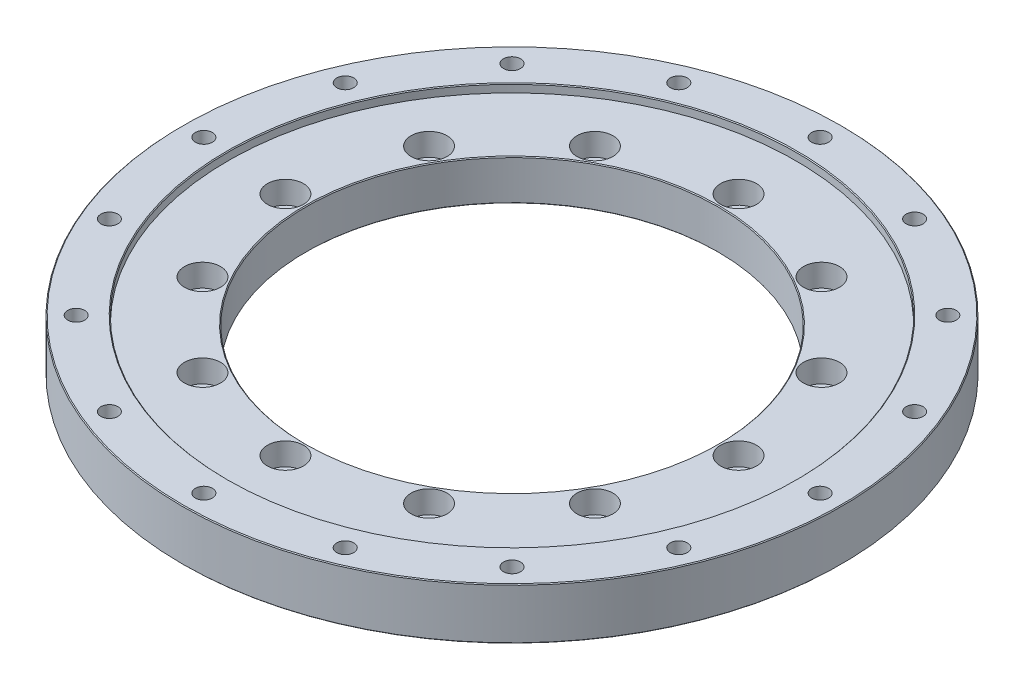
ISO-10303-21;
HEADER;
FILE_DESCRIPTION(('STEP AP214'),'2;1');
FILE_NAME('part.step','',(''),(''),'','','');
FILE_SCHEMA(('AUTOMOTIVE_DESIGN { 1 0 10303 214 1 1 1 1 }'));
ENDSEC;
DATA;
#1=APPLICATION_CONTEXT('core data for automotive mechanical design processes');
#2=APPLICATION_PROTOCOL_DEFINITION('international standard','automotive_design',2000,#1);
#3=PRODUCT_CONTEXT('',#1,'mechanical');
#4=PRODUCT('Part','Part','',(#3));
#5=PRODUCT_RELATED_PRODUCT_CATEGORY('part','',(#4));
#6=PRODUCT_DEFINITION_FORMATION('','',#4);
#7=PRODUCT_DEFINITION_CONTEXT('part definition',#1,'design');
#8=PRODUCT_DEFINITION('design','',#6,#7);
#9=PRODUCT_DEFINITION_SHAPE('','',#8);
#10=(LENGTH_UNIT() NAMED_UNIT(*) SI_UNIT(.MILLI.,.METRE.));
#11=(NAMED_UNIT(*) PLANE_ANGLE_UNIT() SI_UNIT($,.RADIAN.));
#12=(NAMED_UNIT(*) SI_UNIT($,.STERADIAN.) SOLID_ANGLE_UNIT());
#13=UNCERTAINTY_MEASURE_WITH_UNIT(LENGTH_MEASURE(1.E-05),#10,'distance_accuracy_value','');
#14=(GEOMETRIC_REPRESENTATION_CONTEXT(3) GLOBAL_UNCERTAINTY_ASSIGNED_CONTEXT((#13)) GLOBAL_UNIT_ASSIGNED_CONTEXT((#10,
#11,#12)) REPRESENTATION_CONTEXT('',''));
#15=CARTESIAN_POINT('',(0.,0.,0.));
#16=DIRECTION('',(0.,0.,1.));
#17=DIRECTION('',(1.,0.,0.));
#18=AXIS2_PLACEMENT_3D('',#15,#16,#17);
#19=CARTESIAN_POINT('',(0.,211.62264,-1.54165569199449E-13));
#20=DIRECTION('',(0.,1.,0.));
#21=DIRECTION('',(0.,0.,1.));
#22=AXIS2_PLACEMENT_3D('',#19,#20,#21);
#23=PLANE('',#22);
#24=CARTESIAN_POINT('',(0.,211.62264,0.));
#25=DIRECTION('',(0.,1.,0.));
#26=DIRECTION('',(0.,0.,1.));
#27=AXIS2_PLACEMENT_3D('',#24,#25,#26);
#28=CIRCLE('',#27,175.633000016);
#29=CARTESIAN_POINT('',(0.,211.62264,175.633000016));
#30=VERTEX_POINT('',#29);
#31=EDGE_CURVE('E72',#30,#30,#28,.F.);
#32=ORIENTED_EDGE('',*,*,#31,.T.);
#33=EDGE_LOOP('',(#32));
#34=FACE_BOUND('',#33,.T.);
#35=CARTESIAN_POINT('',(0.,211.62264,0.));
#36=DIRECTION('',(0.,1.,0.));
#37=DIRECTION('',(0.,0.,1.));
#38=AXIS2_PLACEMENT_3D('',#35,#36,#37);
#39=CIRCLE('',#38,202.692);
#40=CARTESIAN_POINT('',(0.,211.62264,202.692));
#41=VERTEX_POINT('',#40);
#42=EDGE_CURVE('E81',#41,#41,#39,.T.);
#43=ORIENTED_EDGE('',*,*,#42,.T.);
#44=EDGE_LOOP('',(#43));
#45=FACE_BOUND('',#44,.T.);
#46=CARTESIAN_POINT('',(0.,211.62264,-190.));
#47=DIRECTION('',(0.,-1.,0.));
#48=DIRECTION('',(0.,0.,-1.));
#49=AXIS2_PLACEMENT_3D('',#46,#47,#48);
#50=CIRCLE('',#49,5.24999999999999);
#51=CARTESIAN_POINT('',(0.,211.62264,-195.25));
#52=VERTEX_POINT('',#51);
#53=EDGE_CURVE('E330',#52,#52,#50,.T.);
#54=ORIENTED_EDGE('',*,*,#53,.T.);
#55=EDGE_LOOP('',(#54));
#56=FACE_BOUND('',#55,.T.);
#57=CARTESIAN_POINT('',(-72.7098521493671,211.62264,-175.537111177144));
#58=DIRECTION('',(0.,-1.,0.));
#59=DIRECTION('',(0.,0.,-1.));
#60=AXIS2_PLACEMENT_3D('',#57,#58,#59);
#61=CIRCLE('',#60,5.24999999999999);
#62=CARTESIAN_POINT('',(-72.7098521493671,211.62264,-180.787111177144));
#63=VERTEX_POINT('',#62);
#64=EDGE_CURVE('E324',#63,#63,#61,.T.);
#65=ORIENTED_EDGE('',*,*,#64,.T.);
#66=EDGE_LOOP('',(#65));
#67=FACE_BOUND('',#66,.T.);
#68=CARTESIAN_POINT('',(-134.350288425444,211.62264,-134.350288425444));
#69=DIRECTION('',(0.,-1.,0.));
#70=DIRECTION('',(0.,0.,-1.));
#71=AXIS2_PLACEMENT_3D('',#68,#69,#70);
#72=CIRCLE('',#71,5.25);
#73=CARTESIAN_POINT('',(-134.350288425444,211.62264,-139.600288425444));
#74=VERTEX_POINT('',#73);
#75=EDGE_CURVE('E318',#74,#74,#72,.T.);
#76=ORIENTED_EDGE('',*,*,#75,.T.);
#77=EDGE_LOOP('',(#76));
#78=FACE_BOUND('',#77,.T.);
#79=CARTESIAN_POINT('',(-175.537111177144,211.62264,-72.7098521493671));
#80=DIRECTION('',(0.,-1.,0.));
#81=DIRECTION('',(0.,0.,-1.));
#82=AXIS2_PLACEMENT_3D('',#79,#80,#81);
#83=CIRCLE('',#82,5.25);
#84=CARTESIAN_POINT('',(-175.537111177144,211.62264,-77.9598521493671));
#85=VERTEX_POINT('',#84);
#86=EDGE_CURVE('E312',#85,#85,#83,.T.);
#87=ORIENTED_EDGE('',*,*,#86,.T.);
#88=EDGE_LOOP('',(#87));
#89=FACE_BOUND('',#88,.T.);
#90=CARTESIAN_POINT('',(-190.,211.62264,0.));
#91=DIRECTION('',(0.,-1.,0.));
#92=DIRECTION('',(0.,0.,-1.));
#93=AXIS2_PLACEMENT_3D('',#90,#91,#92);
#94=CIRCLE('',#93,5.25);
#95=CARTESIAN_POINT('',(-190.,211.62264,-5.25000000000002));
#96=VERTEX_POINT('',#95);
#97=EDGE_CURVE('E306',#96,#96,#94,.T.);
#98=ORIENTED_EDGE('',*,*,#97,.T.);
#99=EDGE_LOOP('',(#98));
#100=FACE_BOUND('',#99,.T.);
#101=CARTESIAN_POINT('',(-175.537111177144,211.62264,72.7098521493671));
#102=DIRECTION('',(0.,-1.,0.));
#103=DIRECTION('',(0.,0.,-1.));
#104=AXIS2_PLACEMENT_3D('',#101,#102,#103);
#105=CIRCLE('',#104,5.25);
#106=CARTESIAN_POINT('',(-175.537111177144,211.62264,67.4598521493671));
#107=VERTEX_POINT('',#106);
#108=EDGE_CURVE('E300',#107,#107,#105,.T.);
#109=ORIENTED_EDGE('',*,*,#108,.T.);
#110=EDGE_LOOP('',(#109));
#111=FACE_BOUND('',#110,.T.);
#112=CARTESIAN_POINT('',(-134.350288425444,211.62264,134.350288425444));
#113=DIRECTION('',(0.,-1.,0.));
#114=DIRECTION('',(0.,0.,-1.));
#115=AXIS2_PLACEMENT_3D('',#112,#113,#114);
#116=CIRCLE('',#115,5.25);
#117=CARTESIAN_POINT('',(-134.350288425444,211.62264,129.100288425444));
#118=VERTEX_POINT('',#117);
#119=EDGE_CURVE('E294',#118,#118,#116,.T.);
#120=ORIENTED_EDGE('',*,*,#119,.T.);
#121=EDGE_LOOP('',(#120));
#122=FACE_BOUND('',#121,.T.);
#123=CARTESIAN_POINT('',(-72.7098521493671,211.62264,175.537111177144));
#124=DIRECTION('',(0.,-1.,0.));
#125=DIRECTION('',(0.,0.,-1.));
#126=AXIS2_PLACEMENT_3D('',#123,#124,#125);
#127=CIRCLE('',#126,5.24999999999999);
#128=CARTESIAN_POINT('',(-72.7098521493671,211.62264,170.287111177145));
#129=VERTEX_POINT('',#128);
#130=EDGE_CURVE('E288',#129,#129,#127,.T.);
#131=ORIENTED_EDGE('',*,*,#130,.T.);
#132=EDGE_LOOP('',(#131));
#133=FACE_BOUND('',#132,.T.);
#134=CARTESIAN_POINT('',(0.,211.62264,190.));
#135=DIRECTION('',(0.,-1.,0.));
#136=DIRECTION('',(0.,0.,-1.));
#137=AXIS2_PLACEMENT_3D('',#134,#135,#136);
#138=CIRCLE('',#137,5.24999999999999);
#139=CARTESIAN_POINT('',(0.,211.62264,184.75));
#140=VERTEX_POINT('',#139);
#141=EDGE_CURVE('E282',#140,#140,#138,.T.);
#142=ORIENTED_EDGE('',*,*,#141,.T.);
#143=EDGE_LOOP('',(#142));
#144=FACE_BOUND('',#143,.T.);
#145=CARTESIAN_POINT('',(72.709852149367,211.62264,175.537111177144));
#146=DIRECTION('',(0.,-1.,0.));
#147=DIRECTION('',(0.,0.,-1.));
#148=AXIS2_PLACEMENT_3D('',#145,#146,#147);
#149=CIRCLE('',#148,5.24999999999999);
#150=CARTESIAN_POINT('',(72.709852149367,211.62264,170.287111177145));
#151=VERTEX_POINT('',#150);
#152=EDGE_CURVE('E276',#151,#151,#149,.T.);
#153=ORIENTED_EDGE('',*,*,#152,.T.);
#154=EDGE_LOOP('',(#153));
#155=FACE_BOUND('',#154,.T.);
#156=CARTESIAN_POINT('',(72.7098521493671,211.62264,-175.537111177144));
#157=DIRECTION('',(0.,-1.,0.));
#158=DIRECTION('',(0.,0.,-1.));
#159=AXIS2_PLACEMENT_3D('',#156,#157,#158);
#160=CIRCLE('',#159,5.24999999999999);
#161=CARTESIAN_POINT('',(72.7098521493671,211.62264,-180.787111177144));
#162=VERTEX_POINT('',#161);
#163=EDGE_CURVE('E240',#162,#162,#160,.T.);
#164=ORIENTED_EDGE('',*,*,#163,.T.);
#165=EDGE_LOOP('',(#164));
#166=FACE_BOUND('',#165,.T.);
#167=CARTESIAN_POINT('',(134.350288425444,211.62264,-134.350288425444));
#168=DIRECTION('',(0.,-1.,0.));
#169=DIRECTION('',(0.,0.,-1.));
#170=AXIS2_PLACEMENT_3D('',#167,#168,#169);
#171=CIRCLE('',#170,5.25);
#172=CARTESIAN_POINT('',(134.350288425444,211.62264,-139.600288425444));
#173=VERTEX_POINT('',#172);
#174=EDGE_CURVE('E246',#173,#173,#171,.T.);
#175=ORIENTED_EDGE('',*,*,#174,.T.);
#176=EDGE_LOOP('',(#175));
#177=FACE_BOUND('',#176,.T.);
#178=CARTESIAN_POINT('',(175.537111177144,211.62264,-72.7098521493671));
#179=DIRECTION('',(0.,-1.,0.));
#180=DIRECTION('',(0.,0.,-1.));
#181=AXIS2_PLACEMENT_3D('',#178,#179,#180);
#182=CIRCLE('',#181,5.25);
#183=CARTESIAN_POINT('',(175.537111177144,211.62264,-77.9598521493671));
#184=VERTEX_POINT('',#183);
#185=EDGE_CURVE('E252',#184,#184,#182,.T.);
#186=ORIENTED_EDGE('',*,*,#185,.T.);
#187=EDGE_LOOP('',(#186));
#188=FACE_BOUND('',#187,.T.);
#189=CARTESIAN_POINT('',(190.,211.62264,0.));
#190=DIRECTION('',(0.,-1.,0.));
#191=DIRECTION('',(0.,0.,-1.));
#192=AXIS2_PLACEMENT_3D('',#189,#190,#191);
#193=CIRCLE('',#192,5.25);
#194=CARTESIAN_POINT('',(190.,211.62264,-5.24999999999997));
#195=VERTEX_POINT('',#194);
#196=EDGE_CURVE('E258',#195,#195,#193,.T.);
#197=ORIENTED_EDGE('',*,*,#196,.T.);
#198=EDGE_LOOP('',(#197));
#199=FACE_BOUND('',#198,.T.);
#200=CARTESIAN_POINT('',(175.537111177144,211.62264,72.7098521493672));
#201=DIRECTION('',(0.,-1.,0.));
#202=DIRECTION('',(0.,0.,-1.));
#203=AXIS2_PLACEMENT_3D('',#200,#201,#202);
#204=CIRCLE('',#203,5.25);
#205=CARTESIAN_POINT('',(175.537111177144,211.62264,67.4598521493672));
#206=VERTEX_POINT('',#205);
#207=EDGE_CURVE('E264',#206,#206,#204,.T.);
#208=ORIENTED_EDGE('',*,*,#207,.T.);
#209=EDGE_LOOP('',(#208));
#210=FACE_BOUND('',#209,.T.);
#211=CARTESIAN_POINT('',(134.350288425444,211.62264,134.350288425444));
#212=DIRECTION('',(0.,-1.,0.));
#213=DIRECTION('',(0.,0.,-1.));
#214=AXIS2_PLACEMENT_3D('',#211,#212,#213);
#215=CIRCLE('',#214,5.25);
#216=CARTESIAN_POINT('',(134.350288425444,211.62264,129.100288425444));
#217=VERTEX_POINT('',#216);
#218=EDGE_CURVE('E270',#217,#217,#215,.T.);
#219=ORIENTED_EDGE('',*,*,#218,.T.);
#220=EDGE_LOOP('',(#219));
#221=FACE_BOUND('',#220,.T.);
#222=ADVANCED_FACE('F46',(#34,#45,#56,#67,#78,#89,#100,#111,#122,#133,#144,#155,#166,#177,#188,
#199,#210,#221),#23,.T.);
#223=CARTESIAN_POINT('',(0.,179.87264,0.));
#224=DIRECTION('',(0.,1.,0.));
#225=DIRECTION('',(0.,0.,1.));
#226=AXIS2_PLACEMENT_3D('',#223,#224,#225);
#227=PLANE('',#226);
#228=CARTESIAN_POINT('',(0.,179.87264,0.));
#229=DIRECTION('',(0.,1.,0.));
#230=DIRECTION('',(0.,0.,1.));
#231=AXIS2_PLACEMENT_3D('',#228,#229,#230);
#232=CIRCLE('',#231,153.1112);
#233=CARTESIAN_POINT('',(0.,179.87264,153.1112));
#234=VERTEX_POINT('',#233);
#235=EDGE_CURVE('E12',#234,#234,#232,.T.);
#236=ORIENTED_EDGE('',*,*,#235,.T.);
#237=EDGE_LOOP('',(#236));
#238=FACE_BOUND('',#237,.T.);
#239=CARTESIAN_POINT('',(0.,179.87264,0.));
#240=DIRECTION('',(0.,1.,0.));
#241=DIRECTION('',(0.,0.,1.));
#242=AXIS2_PLACEMENT_3D('',#239,#240,#241);
#243=CIRCLE('',#242,202.692);
#244=CARTESIAN_POINT('',(0.,179.87264,202.692));
#245=VERTEX_POINT('',#244);
#246=EDGE_CURVE('E78',#245,#245,#243,.F.);
#247=ORIENTED_EDGE('',*,*,#246,.T.);
#248=EDGE_LOOP('',(#247));
#249=FACE_BOUND('',#248,.T.);
#250=CARTESIAN_POINT('',(0.,179.87264,-190.));
#251=DIRECTION('',(0.,-1.,0.));
#252=DIRECTION('',(0.,0.,-1.));
#253=AXIS2_PLACEMENT_3D('',#250,#251,#252);
#254=CIRCLE('',#253,5.25);
#255=CARTESIAN_POINT('',(0.,179.87264,-195.25));
#256=VERTEX_POINT('',#255);
#257=EDGE_CURVE('E333',#256,#256,#254,.T.);
#258=ORIENTED_EDGE('',*,*,#257,.F.);
#259=EDGE_LOOP('',(#258));
#260=FACE_BOUND('',#259,.T.);
#261=CARTESIAN_POINT('',(-72.7098521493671,179.87264,-175.537111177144));
#262=DIRECTION('',(0.,-1.,0.));
#263=DIRECTION('',(0.,0.,-1.));
#264=AXIS2_PLACEMENT_3D('',#261,#262,#263);
#265=CIRCLE('',#264,5.24999999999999);
#266=CARTESIAN_POINT('',(-72.7098521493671,179.87264,-180.787111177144));
#267=VERTEX_POINT('',#266);
#268=EDGE_CURVE('E327',#267,#267,#265,.T.);
#269=ORIENTED_EDGE('',*,*,#268,.F.);
#270=EDGE_LOOP('',(#269));
#271=FACE_BOUND('',#270,.T.);
#272=CARTESIAN_POINT('',(-134.350288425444,179.87264,-134.350288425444));
#273=DIRECTION('',(0.,-1.,0.));
#274=DIRECTION('',(0.,0.,-1.));
#275=AXIS2_PLACEMENT_3D('',#272,#273,#274);
#276=CIRCLE('',#275,5.25);
#277=CARTESIAN_POINT('',(-134.350288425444,179.87264,-139.600288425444));
#278=VERTEX_POINT('',#277);
#279=EDGE_CURVE('E321',#278,#278,#276,.T.);
#280=ORIENTED_EDGE('',*,*,#279,.F.);
#281=EDGE_LOOP('',(#280));
#282=FACE_BOUND('',#281,.T.);
#283=CARTESIAN_POINT('',(-175.537111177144,179.87264,-72.7098521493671));
#284=DIRECTION('',(0.,-1.,0.));
#285=DIRECTION('',(0.,0.,-1.));
#286=AXIS2_PLACEMENT_3D('',#283,#284,#285);
#287=CIRCLE('',#286,5.25);
#288=CARTESIAN_POINT('',(-175.537111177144,179.87264,-77.9598521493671));
#289=VERTEX_POINT('',#288);
#290=EDGE_CURVE('E315',#289,#289,#287,.T.);
#291=ORIENTED_EDGE('',*,*,#290,.F.);
#292=EDGE_LOOP('',(#291));
#293=FACE_BOUND('',#292,.T.);
#294=CARTESIAN_POINT('',(-190.,179.87264,0.));
#295=DIRECTION('',(0.,-1.,0.));
#296=DIRECTION('',(0.,0.,-1.));
#297=AXIS2_PLACEMENT_3D('',#294,#295,#296);
#298=CIRCLE('',#297,5.25);
#299=CARTESIAN_POINT('',(-190.,179.87264,-5.25000000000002));
#300=VERTEX_POINT('',#299);
#301=EDGE_CURVE('E309',#300,#300,#298,.T.);
#302=ORIENTED_EDGE('',*,*,#301,.F.);
#303=EDGE_LOOP('',(#302));
#304=FACE_BOUND('',#303,.T.);
#305=CARTESIAN_POINT('',(-175.537111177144,179.87264,72.7098521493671));
#306=DIRECTION('',(0.,-1.,0.));
#307=DIRECTION('',(0.,0.,-1.));
#308=AXIS2_PLACEMENT_3D('',#305,#306,#307);
#309=CIRCLE('',#308,5.25);
#310=CARTESIAN_POINT('',(-175.537111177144,179.87264,67.4598521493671));
#311=VERTEX_POINT('',#310);
#312=EDGE_CURVE('E303',#311,#311,#309,.T.);
#313=ORIENTED_EDGE('',*,*,#312,.F.);
#314=EDGE_LOOP('',(#313));
#315=FACE_BOUND('',#314,.T.);
#316=CARTESIAN_POINT('',(-134.350288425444,179.87264,134.350288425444));
#317=DIRECTION('',(0.,-1.,0.));
#318=DIRECTION('',(0.,0.,-1.));
#319=AXIS2_PLACEMENT_3D('',#316,#317,#318);
#320=CIRCLE('',#319,5.25);
#321=CARTESIAN_POINT('',(-134.350288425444,179.87264,129.100288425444));
#322=VERTEX_POINT('',#321);
#323=EDGE_CURVE('E297',#322,#322,#320,.T.);
#324=ORIENTED_EDGE('',*,*,#323,.F.);
#325=EDGE_LOOP('',(#324));
#326=FACE_BOUND('',#325,.T.);
#327=CARTESIAN_POINT('',(-72.7098521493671,179.87264,175.537111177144));
#328=DIRECTION('',(0.,-1.,0.));
#329=DIRECTION('',(0.,0.,-1.));
#330=AXIS2_PLACEMENT_3D('',#327,#328,#329);
#331=CIRCLE('',#330,5.24999999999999);
#332=CARTESIAN_POINT('',(-72.7098521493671,179.87264,170.287111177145));
#333=VERTEX_POINT('',#332);
#334=EDGE_CURVE('E291',#333,#333,#331,.T.);
#335=ORIENTED_EDGE('',*,*,#334,.F.);
#336=EDGE_LOOP('',(#335));
#337=FACE_BOUND('',#336,.T.);
#338=CARTESIAN_POINT('',(0.,179.87264,190.));
#339=DIRECTION('',(0.,-1.,0.));
#340=DIRECTION('',(0.,0.,-1.));
#341=AXIS2_PLACEMENT_3D('',#338,#339,#340);
#342=CIRCLE('',#341,5.25);
#343=CARTESIAN_POINT('',(0.,179.87264,184.75));
#344=VERTEX_POINT('',#343);
#345=EDGE_CURVE('E285',#344,#344,#342,.T.);
#346=ORIENTED_EDGE('',*,*,#345,.F.);
#347=EDGE_LOOP('',(#346));
#348=FACE_BOUND('',#347,.T.);
#349=CARTESIAN_POINT('',(72.709852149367,179.87264,175.537111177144));
#350=DIRECTION('',(0.,-1.,0.));
#351=DIRECTION('',(0.,0.,-1.));
#352=AXIS2_PLACEMENT_3D('',#349,#350,#351);
#353=CIRCLE('',#352,5.24999999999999);
#354=CARTESIAN_POINT('',(72.709852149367,179.87264,170.287111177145));
#355=VERTEX_POINT('',#354);
#356=EDGE_CURVE('E279',#355,#355,#353,.T.);
#357=ORIENTED_EDGE('',*,*,#356,.F.);
#358=EDGE_LOOP('',(#357));
#359=FACE_BOUND('',#358,.T.);
#360=CARTESIAN_POINT('',(134.350288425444,179.87264,134.350288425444));
#361=DIRECTION('',(0.,-1.,0.));
#362=DIRECTION('',(0.,0.,-1.));
#363=AXIS2_PLACEMENT_3D('',#360,#361,#362);
#364=CIRCLE('',#363,5.25);
#365=CARTESIAN_POINT('',(134.350288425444,179.87264,129.100288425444));
#366=VERTEX_POINT('',#365);
#367=EDGE_CURVE('E273',#366,#366,#364,.T.);
#368=ORIENTED_EDGE('',*,*,#367,.F.);
#369=EDGE_LOOP('',(#368));
#370=FACE_BOUND('',#369,.T.);
#371=CARTESIAN_POINT('',(175.537111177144,179.87264,72.7098521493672));
#372=DIRECTION('',(0.,-1.,0.));
#373=DIRECTION('',(0.,0.,-1.));
#374=AXIS2_PLACEMENT_3D('',#371,#372,#373);
#375=CIRCLE('',#374,5.25);
#376=CARTESIAN_POINT('',(175.537111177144,179.87264,67.4598521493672));
#377=VERTEX_POINT('',#376);
#378=EDGE_CURVE('E267',#377,#377,#375,.T.);
#379=ORIENTED_EDGE('',*,*,#378,.F.);
#380=EDGE_LOOP('',(#379));
#381=FACE_BOUND('',#380,.T.);
#382=CARTESIAN_POINT('',(190.,179.87264,0.));
#383=DIRECTION('',(0.,-1.,0.));
#384=DIRECTION('',(0.,0.,-1.));
#385=AXIS2_PLACEMENT_3D('',#382,#383,#384);
#386=CIRCLE('',#385,5.25);
#387=CARTESIAN_POINT('',(190.,179.87264,-5.24999999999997));
#388=VERTEX_POINT('',#387);
#389=EDGE_CURVE('E261',#388,#388,#386,.T.);
#390=ORIENTED_EDGE('',*,*,#389,.F.);
#391=EDGE_LOOP('',(#390));
#392=FACE_BOUND('',#391,.T.);
#393=CARTESIAN_POINT('',(134.350288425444,179.87264,-134.350288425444));
#394=DIRECTION('',(0.,-1.,0.));
#395=DIRECTION('',(0.,0.,-1.));
#396=AXIS2_PLACEMENT_3D('',#393,#394,#395);
#397=CIRCLE('',#396,5.25);
#398=CARTESIAN_POINT('',(134.350288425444,179.87264,-139.600288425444));
#399=VERTEX_POINT('',#398);
#400=EDGE_CURVE('E249',#399,#399,#397,.T.);
#401=ORIENTED_EDGE('',*,*,#400,.F.);
#402=EDGE_LOOP('',(#401));
#403=FACE_BOUND('',#402,.T.);
#404=CARTESIAN_POINT('',(72.7098521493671,179.87264,-175.537111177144));
#405=DIRECTION('',(0.,-1.,0.));
#406=DIRECTION('',(0.,0.,-1.));
#407=AXIS2_PLACEMENT_3D('',#404,#405,#406);
#408=CIRCLE('',#407,5.24999999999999);
#409=CARTESIAN_POINT('',(72.7098521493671,179.87264,-180.787111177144));
#410=VERTEX_POINT('',#409);
#411=EDGE_CURVE('E243',#410,#410,#408,.T.);
#412=ORIENTED_EDGE('',*,*,#411,.F.);
#413=EDGE_LOOP('',(#412));
#414=FACE_BOUND('',#413,.T.);
#415=CARTESIAN_POINT('',(175.537111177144,179.87264,-72.7098521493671));
#416=DIRECTION('',(0.,-1.,0.));
#417=DIRECTION('',(0.,0.,-1.));
#418=AXIS2_PLACEMENT_3D('',#415,#416,#417);
#419=CIRCLE('',#418,5.25);
#420=CARTESIAN_POINT('',(175.537111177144,179.87264,-77.9598521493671));
#421=VERTEX_POINT('',#420);
#422=EDGE_CURVE('E255',#421,#421,#419,.T.);
#423=ORIENTED_EDGE('',*,*,#422,.F.);
#424=EDGE_LOOP('',(#423));
#425=FACE_BOUND('',#424,.T.);
#426=ADVANCED_FACE('F339',(#238,#249,#260,#271,#282,#293,#304,#315,#326,#337,#348,#359,#370,
#381,#392,#403,#414,#425),#227,.F.);
#427=CARTESIAN_POINT('',(0.,0.,0.));
#428=DIRECTION('',(0.,-1.,0.));
#429=DIRECTION('',(0.,0.,-1.));
#430=AXIS2_PLACEMENT_3D('',#427,#428,#429);
#431=CYLINDRICAL_SURFACE('',#430,127.);
#432=CARTESIAN_POINT('',(0.,206.03464,0.));
#433=DIRECTION('',(0.,1.,0.));
#434=DIRECTION('',(0.,0.,1.));
#435=AXIS2_PLACEMENT_3D('',#432,#433,#434);
#436=CIRCLE('',#435,127.);
#437=CARTESIAN_POINT('',(0.,206.03464,127.));
#438=VERTEX_POINT('',#437);
#439=EDGE_CURVE('E66',#438,#438,#436,.T.);
#440=ORIENTED_EDGE('',*,*,#439,.T.);
#441=EDGE_LOOP('',(#440));
#442=FACE_BOUND('',#441,.T.);
#443=CARTESIAN_POINT('',(0.,181.96814,0.));
#444=DIRECTION('',(0.,1.,0.));
#445=DIRECTION('',(0.,0.,1.));
#446=AXIS2_PLACEMENT_3D('',#443,#444,#445);
#447=CIRCLE('',#446,127.);
#448=CARTESIAN_POINT('',(0.,181.96814,127.));
#449=VERTEX_POINT('',#448);
#450=EDGE_CURVE('E69',#449,#449,#447,.F.);
#451=ORIENTED_EDGE('',*,*,#450,.T.);
#452=EDGE_LOOP('',(#451));
#453=FACE_BOUND('',#452,.T.);
#454=ADVANCED_FACE('F342',(#442,#453),#431,.F.);
#455=CARTESIAN_POINT('',(0.,0.,0.));
#456=DIRECTION('',(0.,-1.,0.));
#457=DIRECTION('',(0.,0.,-1.));
#458=AXIS2_PLACEMENT_3D('',#455,#456,#457);
#459=CYLINDRICAL_SURFACE('',#458,152.6032);
#460=CARTESIAN_POINT('',(0.,180.38064,0.));
#461=DIRECTION('',(0.,1.,0.));
#462=DIRECTION('',(0.,0.,1.));
#463=AXIS2_PLACEMENT_3D('',#460,#461,#462);
#464=CIRCLE('',#463,152.6032);
#465=CARTESIAN_POINT('',(0.,180.38064,152.6032));
#466=VERTEX_POINT('',#465);
#467=EDGE_CURVE('E53',#466,#466,#464,.F.);
#468=ORIENTED_EDGE('',*,*,#467,.T.);
#469=EDGE_LOOP('',(#468));
#470=FACE_BOUND('',#469,.T.);
#471=CARTESIAN_POINT('',(0.,181.46014,0.));
#472=DIRECTION('',(0.,-1.,0.));
#473=DIRECTION('',(0.,0.,-1.));
#474=AXIS2_PLACEMENT_3D('',#471,#472,#473);
#475=CIRCLE('',#474,152.6032);
#476=CARTESIAN_POINT('',(0.,181.46014,-152.6032));
#477=VERTEX_POINT('',#476);
#478=EDGE_CURVE('E90',#477,#477,#475,.T.);
#479=ORIENTED_EDGE('',*,*,#478,.F.);
#480=EDGE_LOOP('',(#479));
#481=FACE_BOUND('',#480,.T.);
#482=ADVANCED_FACE('F402',(#470,#481),#459,.F.);
#483=CARTESIAN_POINT('',(0.,181.46014,-2.47860759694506E-11));
#484=DIRECTION('',(0.,1.,0.));
#485=DIRECTION('',(0.,0.,1.));
#486=AXIS2_PLACEMENT_3D('',#483,#484,#485);
#487=PLANE('',#486);
#488=CARTESIAN_POINT('',(0.,181.46014,0.));
#489=DIRECTION('',(0.,1.,0.));
#490=DIRECTION('',(0.,0.,1.));
#491=AXIS2_PLACEMENT_3D('',#488,#489,#490);
#492=CIRCLE('',#491,127.508);
#493=CARTESIAN_POINT('',(0.,181.46014,127.508));
#494=VERTEX_POINT('',#493);
#495=EDGE_CURVE('E57',#494,#494,#492,.T.);
#496=ORIENTED_EDGE('',*,*,#495,.T.);
#497=EDGE_LOOP('',(#496));
#498=FACE_BOUND('',#497,.T.);
#499=CARTESIAN_POINT('',(69.85,181.46014,120.983748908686));
#500=DIRECTION('',(0.,1.,0.));
#501=DIRECTION('',(0.,0.,1.));
#502=AXIS2_PLACEMENT_3D('',#499,#500,#501);
#503=CIRCLE('',#502,5.04189999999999);
#504=CARTESIAN_POINT('',(69.85,181.46014,126.025648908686));
#505=VERTEX_POINT('',#504);
#506=EDGE_CURVE('E91',#505,#505,#503,.T.);
#507=ORIENTED_EDGE('',*,*,#506,.T.);
#508=EDGE_LOOP('',(#507));
#509=FACE_BOUND('',#508,.T.);
#510=CARTESIAN_POINT('',(120.983748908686,181.46014,69.85));
#511=DIRECTION('',(0.,1.,0.));
#512=DIRECTION('',(0.,0.,1.));
#513=AXIS2_PLACEMENT_3D('',#510,#511,#512);
#514=CIRCLE('',#513,5.04189999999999);
#515=CARTESIAN_POINT('',(120.983748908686,181.46014,74.8919));
#516=VERTEX_POINT('',#515);
#517=EDGE_CURVE('E96',#516,#516,#514,.T.);
#518=ORIENTED_EDGE('',*,*,#517,.T.);
#519=EDGE_LOOP('',(#518));
#520=FACE_BOUND('',#519,.T.);
#521=CARTESIAN_POINT('',(139.7,181.46014,0.));
#522=DIRECTION('',(0.,1.,0.));
#523=DIRECTION('',(0.,0.,1.));
#524=AXIS2_PLACEMENT_3D('',#521,#522,#523);
#525=CIRCLE('',#524,5.04189999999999);
#526=CARTESIAN_POINT('',(139.7,181.46014,5.04190000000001));
#527=VERTEX_POINT('',#526);
#528=EDGE_CURVE('E101',#527,#527,#525,.T.);
#529=ORIENTED_EDGE('',*,*,#528,.T.);
#530=EDGE_LOOP('',(#529));
#531=FACE_BOUND('',#530,.T.);
#532=CARTESIAN_POINT('',(120.983748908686,181.46014,-69.8499999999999));
#533=DIRECTION('',(0.,1.,0.));
#534=DIRECTION('',(0.,0.,1.));
#535=AXIS2_PLACEMENT_3D('',#532,#533,#534);
#536=CIRCLE('',#535,5.04189999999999);
#537=CARTESIAN_POINT('',(120.983748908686,181.46014,-64.8081));
#538=VERTEX_POINT('',#537);
#539=EDGE_CURVE('E106',#538,#538,#536,.T.);
#540=ORIENTED_EDGE('',*,*,#539,.T.);
#541=EDGE_LOOP('',(#540));
#542=FACE_BOUND('',#541,.T.);
#543=CARTESIAN_POINT('',(69.8500000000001,181.46014,-120.983748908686));
#544=DIRECTION('',(0.,1.,0.));
#545=DIRECTION('',(0.,0.,1.));
#546=AXIS2_PLACEMENT_3D('',#543,#544,#545);
#547=CIRCLE('',#546,5.04189999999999);
#548=CARTESIAN_POINT('',(69.8500000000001,181.46014,-115.941848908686));
#549=VERTEX_POINT('',#548);
#550=EDGE_CURVE('E111',#549,#549,#547,.T.);
#551=ORIENTED_EDGE('',*,*,#550,.T.);
#552=EDGE_LOOP('',(#551));
#553=FACE_BOUND('',#552,.T.);
#554=CARTESIAN_POINT('',(0.,181.46014,-139.7));
#555=DIRECTION('',(0.,1.,0.));
#556=DIRECTION('',(0.,0.,1.));
#557=AXIS2_PLACEMENT_3D('',#554,#555,#556);
#558=CIRCLE('',#557,5.04189999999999);
#559=CARTESIAN_POINT('',(0.,181.46014,-134.6581));
#560=VERTEX_POINT('',#559);
#561=EDGE_CURVE('E116',#560,#560,#558,.T.);
#562=ORIENTED_EDGE('',*,*,#561,.T.);
#563=EDGE_LOOP('',(#562));
#564=FACE_BOUND('',#563,.T.);
#565=CARTESIAN_POINT('',(-69.85,181.46014,-120.983748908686));
#566=DIRECTION('',(0.,1.,0.));
#567=DIRECTION('',(0.,0.,1.));
#568=AXIS2_PLACEMENT_3D('',#565,#566,#567);
#569=CIRCLE('',#568,5.04189999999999);
#570=CARTESIAN_POINT('',(-69.85,181.46014,-115.941848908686));
#571=VERTEX_POINT('',#570);
#572=EDGE_CURVE('E121',#571,#571,#569,.T.);
#573=ORIENTED_EDGE('',*,*,#572,.T.);
#574=EDGE_LOOP('',(#573));
#575=FACE_BOUND('',#574,.T.);
#576=CARTESIAN_POINT('',(-120.983748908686,181.46014,-69.85));
#577=DIRECTION('',(0.,1.,0.));
#578=DIRECTION('',(0.,0.,1.));
#579=AXIS2_PLACEMENT_3D('',#576,#577,#578);
#580=CIRCLE('',#579,5.04189999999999);
#581=CARTESIAN_POINT('',(-120.983748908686,181.46014,-64.8081));
#582=VERTEX_POINT('',#581);
#583=EDGE_CURVE('E126',#582,#582,#580,.T.);
#584=ORIENTED_EDGE('',*,*,#583,.T.);
#585=EDGE_LOOP('',(#584));
#586=FACE_BOUND('',#585,.T.);
#587=CARTESIAN_POINT('',(-139.7,181.46014,0.));
#588=DIRECTION('',(0.,1.,0.));
#589=DIRECTION('',(0.,0.,1.));
#590=AXIS2_PLACEMENT_3D('',#587,#588,#589);
#591=CIRCLE('',#590,5.04189999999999);
#592=CARTESIAN_POINT('',(-139.7,181.46014,5.04189999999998));
#593=VERTEX_POINT('',#592);
#594=EDGE_CURVE('E131',#593,#593,#591,.T.);
#595=ORIENTED_EDGE('',*,*,#594,.T.);
#596=EDGE_LOOP('',(#595));
#597=FACE_BOUND('',#596,.T.);
#598=CARTESIAN_POINT('',(-120.983748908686,181.46014,69.8499999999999));
#599=DIRECTION('',(0.,1.,0.));
#600=DIRECTION('',(0.,0.,1.));
#601=AXIS2_PLACEMENT_3D('',#598,#599,#600);
#602=CIRCLE('',#601,5.04189999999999);
#603=CARTESIAN_POINT('',(-120.983748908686,181.46014,74.8918999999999));
#604=VERTEX_POINT('',#603);
#605=EDGE_CURVE('E136',#604,#604,#602,.T.);
#606=ORIENTED_EDGE('',*,*,#605,.T.);
#607=EDGE_LOOP('',(#606));
#608=FACE_BOUND('',#607,.T.);
#609=CARTESIAN_POINT('',(-69.85,181.46014,120.983748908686));
#610=DIRECTION('',(0.,1.,0.));
#611=DIRECTION('',(0.,0.,1.));
#612=AXIS2_PLACEMENT_3D('',#609,#610,#611);
#613=CIRCLE('',#612,5.04189999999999);
#614=CARTESIAN_POINT('',(-69.85,181.46014,126.025648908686));
#615=VERTEX_POINT('',#614);
#616=EDGE_CURVE('E141',#615,#615,#613,.T.);
#617=ORIENTED_EDGE('',*,*,#616,.T.);
#618=EDGE_LOOP('',(#617));
#619=FACE_BOUND('',#618,.T.);
#620=CARTESIAN_POINT('',(0.,181.46014,139.7));
#621=DIRECTION('',(0.,1.,0.));
#622=DIRECTION('',(0.,0.,1.));
#623=AXIS2_PLACEMENT_3D('',#620,#621,#622);
#624=CIRCLE('',#623,5.04189999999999);
#625=CARTESIAN_POINT('',(0.,181.46014,144.7419));
#626=VERTEX_POINT('',#625);
#627=EDGE_CURVE('E146',#626,#626,#624,.T.);
#628=ORIENTED_EDGE('',*,*,#627,.T.);
#629=EDGE_LOOP('',(#628));
#630=FACE_BOUND('',#629,.T.);
#631=ORIENTED_EDGE('',*,*,#478,.T.);
#632=EDGE_LOOP('',(#631));
#633=FACE_BOUND('',#632,.T.);
#634=ADVANCED_FACE('F404',(#498,#509,#520,#531,#542,#553,#564,#575,#586,#597,#608,#619,#630,
#633),#487,.F.);
#635=CARTESIAN_POINT('',(0.,0.,0.));
#636=DIRECTION('',(0.,-1.,0.));
#637=DIRECTION('',(0.,0.,-1.));
#638=AXIS2_PLACEMENT_3D('',#635,#636,#637);
#639=CYLINDRICAL_SURFACE('',#638,203.2);
#640=CARTESIAN_POINT('',(0.,211.11464,0.));
#641=DIRECTION('',(0.,1.,0.));
#642=DIRECTION('',(0.,0.,1.));
#643=AXIS2_PLACEMENT_3D('',#640,#641,#642);
#644=CIRCLE('',#643,203.2);
#645=CARTESIAN_POINT('',(0.,211.11464,203.2));
#646=VERTEX_POINT('',#645);
#647=EDGE_CURVE('E84',#646,#646,#644,.F.);
#648=ORIENTED_EDGE('',*,*,#647,.T.);
#649=EDGE_LOOP('',(#648));
#650=FACE_BOUND('',#649,.T.);
#651=CARTESIAN_POINT('',(0.,180.38064,0.));
#652=DIRECTION('',(0.,1.,0.));
#653=DIRECTION('',(0.,0.,1.));
#654=AXIS2_PLACEMENT_3D('',#651,#652,#653);
#655=CIRCLE('',#654,203.2);
#656=CARTESIAN_POINT('',(0.,180.38064,203.2));
#657=VERTEX_POINT('',#656);
#658=EDGE_CURVE('E87',#657,#657,#655,.T.);
#659=ORIENTED_EDGE('',*,*,#658,.T.);
#660=EDGE_LOOP('',(#659));
#661=FACE_BOUND('',#660,.T.);
#662=ADVANCED_FACE('F399',(#650,#661),#639,.T.);
#663=CARTESIAN_POINT('',(0.,206.54264,0.));
#664=DIRECTION('',(0.,1.,0.));
#665=DIRECTION('',(0.,0.,1.));
#666=AXIS2_PLACEMENT_3D('',#663,#664,#665);
#667=CYLINDRICAL_SURFACE('',#666,175.125000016);
#668=CARTESIAN_POINT('',(0.,211.11464,0.));
#669=DIRECTION('',(0.,1.,0.));
#670=DIRECTION('',(0.,0.,1.));
#671=AXIS2_PLACEMENT_3D('',#668,#669,#670);
#672=CIRCLE('',#671,175.125000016);
#673=CARTESIAN_POINT('',(0.,211.11464,175.125000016));
#674=VERTEX_POINT('',#673);
#675=EDGE_CURVE('E75',#674,#674,#672,.T.);
#676=ORIENTED_EDGE('',*,*,#675,.T.);
#677=EDGE_LOOP('',(#676));
#678=FACE_BOUND('',#677,.T.);
#679=CARTESIAN_POINT('',(0.,206.54264,0.));
#680=DIRECTION('',(0.,1.,0.));
#681=DIRECTION('',(0.,0.,1.));
#682=AXIS2_PLACEMENT_3D('',#679,#680,#681);
#683=CIRCLE('',#682,175.125000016);
#684=CARTESIAN_POINT('',(0.,206.54264,175.125000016));
#685=VERTEX_POINT('',#684);
#686=EDGE_CURVE('E149',#685,#685,#683,.T.);
#687=ORIENTED_EDGE('',*,*,#686,.F.);
#688=EDGE_LOOP('',(#687));
#689=FACE_BOUND('',#688,.T.);
#690=ADVANCED_FACE('F477',(#678,#689),#667,.F.);
#691=CARTESIAN_POINT('',(0.,206.54264,0.));
#692=DIRECTION('',(0.,1.,0.));
#693=DIRECTION('',(0.,0.,1.));
#694=AXIS2_PLACEMENT_3D('',#691,#692,#693);
#695=PLANE('',#694);
#696=CARTESIAN_POINT('',(0.,206.54264,0.));
#697=DIRECTION('',(0.,1.,0.));
#698=DIRECTION('',(0.,0.,1.));
#699=AXIS2_PLACEMENT_3D('',#696,#697,#698);
#700=CIRCLE('',#699,127.508);
#701=CARTESIAN_POINT('',(0.,206.54264,127.508));
#702=VERTEX_POINT('',#701);
#703=EDGE_CURVE('E61',#702,#702,#700,.F.);
#704=ORIENTED_EDGE('',*,*,#703,.T.);
#705=EDGE_LOOP('',(#704));
#706=FACE_BOUND('',#705,.T.);
#707=CARTESIAN_POINT('',(69.85,206.54264,120.983748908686));
#708=DIRECTION('',(0.,-1.,0.));
#709=DIRECTION('',(0.,0.,-1.));
#710=AXIS2_PLACEMENT_3D('',#707,#708,#709);
#711=CIRCLE('',#710,11.1125);
#712=CARTESIAN_POINT('',(69.85,206.54264,109.871248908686));
#713=VERTEX_POINT('',#712);
#714=EDGE_CURVE('E237',#713,#713,#711,.T.);
#715=ORIENTED_EDGE('',*,*,#714,.T.);
#716=EDGE_LOOP('',(#715));
#717=FACE_BOUND('',#716,.T.);
#718=CARTESIAN_POINT('',(120.983748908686,206.54264,69.85));
#719=DIRECTION('',(0.,-1.,0.));
#720=DIRECTION('',(0.,0.,-1.));
#721=AXIS2_PLACEMENT_3D('',#718,#719,#720);
#722=CIRCLE('',#721,11.1125);
#723=CARTESIAN_POINT('',(120.983748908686,206.54264,58.7375));
#724=VERTEX_POINT('',#723);
#725=EDGE_CURVE('E94',#724,#724,#722,.T.);
#726=ORIENTED_EDGE('',*,*,#725,.T.);
#727=EDGE_LOOP('',(#726));
#728=FACE_BOUND('',#727,.T.);
#729=CARTESIAN_POINT('',(139.7,206.54264,0.));
#730=DIRECTION('',(0.,-1.,0.));
#731=DIRECTION('',(0.,0.,-1.));
#732=AXIS2_PLACEMENT_3D('',#729,#730,#731);
#733=CIRCLE('',#732,11.1125);
#734=CARTESIAN_POINT('',(139.7,206.54264,-11.1125));
#735=VERTEX_POINT('',#734);
#736=EDGE_CURVE('E99',#735,#735,#733,.T.);
#737=ORIENTED_EDGE('',*,*,#736,.T.);
#738=EDGE_LOOP('',(#737));
#739=FACE_BOUND('',#738,.T.);
#740=CARTESIAN_POINT('',(120.983748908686,206.54264,-69.8499999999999));
#741=DIRECTION('',(0.,-1.,0.));
#742=DIRECTION('',(0.,0.,-1.));
#743=AXIS2_PLACEMENT_3D('',#740,#741,#742);
#744=CIRCLE('',#743,11.1125);
#745=CARTESIAN_POINT('',(120.983748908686,206.54264,-80.9624999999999));
#746=VERTEX_POINT('',#745);
#747=EDGE_CURVE('E104',#746,#746,#744,.T.);
#748=ORIENTED_EDGE('',*,*,#747,.T.);
#749=EDGE_LOOP('',(#748));
#750=FACE_BOUND('',#749,.T.);
#751=CARTESIAN_POINT('',(69.8500000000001,206.54264,-120.983748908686));
#752=DIRECTION('',(0.,-1.,0.));
#753=DIRECTION('',(0.,0.,-1.));
#754=AXIS2_PLACEMENT_3D('',#751,#752,#753);
#755=CIRCLE('',#754,11.1125);
#756=CARTESIAN_POINT('',(69.8500000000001,206.54264,-132.096248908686));
#757=VERTEX_POINT('',#756);
#758=EDGE_CURVE('E109',#757,#757,#755,.T.);
#759=ORIENTED_EDGE('',*,*,#758,.T.);
#760=EDGE_LOOP('',(#759));
#761=FACE_BOUND('',#760,.T.);
#762=CARTESIAN_POINT('',(0.,206.54264,-139.7));
#763=DIRECTION('',(0.,-1.,0.));
#764=DIRECTION('',(0.,0.,-1.));
#765=AXIS2_PLACEMENT_3D('',#762,#763,#764);
#766=CIRCLE('',#765,11.1125);
#767=CARTESIAN_POINT('',(0.,206.54264,-150.8125));
#768=VERTEX_POINT('',#767);
#769=EDGE_CURVE('E114',#768,#768,#766,.T.);
#770=ORIENTED_EDGE('',*,*,#769,.T.);
#771=EDGE_LOOP('',(#770));
#772=FACE_BOUND('',#771,.T.);
#773=CARTESIAN_POINT('',(-69.85,206.54264,-120.983748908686));
#774=DIRECTION('',(0.,-1.,0.));
#775=DIRECTION('',(0.,0.,-1.));
#776=AXIS2_PLACEMENT_3D('',#773,#774,#775);
#777=CIRCLE('',#776,11.1125);
#778=CARTESIAN_POINT('',(-69.85,206.54264,-132.096248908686));
#779=VERTEX_POINT('',#778);
#780=EDGE_CURVE('E119',#779,#779,#777,.T.);
#781=ORIENTED_EDGE('',*,*,#780,.T.);
#782=EDGE_LOOP('',(#781));
#783=FACE_BOUND('',#782,.T.);
#784=CARTESIAN_POINT('',(-120.983748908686,206.54264,-69.85));
#785=DIRECTION('',(0.,-1.,0.));
#786=DIRECTION('',(0.,0.,-1.));
#787=AXIS2_PLACEMENT_3D('',#784,#785,#786);
#788=CIRCLE('',#787,11.1125);
#789=CARTESIAN_POINT('',(-120.983748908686,206.54264,-80.9625));
#790=VERTEX_POINT('',#789);
#791=EDGE_CURVE('E124',#790,#790,#788,.T.);
#792=ORIENTED_EDGE('',*,*,#791,.T.);
#793=EDGE_LOOP('',(#792));
#794=FACE_BOUND('',#793,.T.);
#795=CARTESIAN_POINT('',(-139.7,206.54264,0.));
#796=DIRECTION('',(0.,-1.,0.));
#797=DIRECTION('',(0.,0.,-1.));
#798=AXIS2_PLACEMENT_3D('',#795,#796,#797);
#799=CIRCLE('',#798,11.1125);
#800=CARTESIAN_POINT('',(-139.7,206.54264,-11.1125));
#801=VERTEX_POINT('',#800);
#802=EDGE_CURVE('E129',#801,#801,#799,.T.);
#803=ORIENTED_EDGE('',*,*,#802,.T.);
#804=EDGE_LOOP('',(#803));
#805=FACE_BOUND('',#804,.T.);
#806=CARTESIAN_POINT('',(-120.983748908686,206.54264,69.8499999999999));
#807=DIRECTION('',(0.,-1.,0.));
#808=DIRECTION('',(0.,0.,-1.));
#809=AXIS2_PLACEMENT_3D('',#806,#807,#808);
#810=CIRCLE('',#809,11.1125);
#811=CARTESIAN_POINT('',(-120.983748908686,206.54264,58.7374999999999));
#812=VERTEX_POINT('',#811);
#813=EDGE_CURVE('E134',#812,#812,#810,.T.);
#814=ORIENTED_EDGE('',*,*,#813,.T.);
#815=EDGE_LOOP('',(#814));
#816=FACE_BOUND('',#815,.T.);
#817=CARTESIAN_POINT('',(-69.85,206.54264,120.983748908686));
#818=DIRECTION('',(0.,-1.,0.));
#819=DIRECTION('',(0.,0.,-1.));
#820=AXIS2_PLACEMENT_3D('',#817,#818,#819);
#821=CIRCLE('',#820,11.1125);
#822=CARTESIAN_POINT('',(-69.85,206.54264,109.871248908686));
#823=VERTEX_POINT('',#822);
#824=EDGE_CURVE('E139',#823,#823,#821,.T.);
#825=ORIENTED_EDGE('',*,*,#824,.T.);
#826=EDGE_LOOP('',(#825));
#827=FACE_BOUND('',#826,.T.);
#828=CARTESIAN_POINT('',(0.,206.54264,139.7));
#829=DIRECTION('',(0.,-1.,0.));
#830=DIRECTION('',(0.,0.,-1.));
#831=AXIS2_PLACEMENT_3D('',#828,#829,#830);
#832=CIRCLE('',#831,11.1125);
#833=CARTESIAN_POINT('',(0.,206.54264,128.5875));
#834=VERTEX_POINT('',#833);
#835=EDGE_CURVE('E144',#834,#834,#832,.T.);
#836=ORIENTED_EDGE('',*,*,#835,.T.);
#837=EDGE_LOOP('',(#836));
#838=FACE_BOUND('',#837,.T.);
#839=ORIENTED_EDGE('',*,*,#686,.T.);
#840=EDGE_LOOP('',(#839));
#841=FACE_BOUND('',#840,.T.);
#842=ADVANCED_FACE('F467',(#706,#717,#728,#739,#750,#761,#772,#783,#794,#805,#816,#827,#838,
#841),#695,.T.);
#843=CARTESIAN_POINT('',(0.,206.54264,139.7));
#844=DIRECTION('',(0.,1.,0.));
#845=DIRECTION('',(0.,0.,-1.));
#846=AXIS2_PLACEMENT_3D('',#843,#844,#845);
#847=CYLINDRICAL_SURFACE('',#846,5.04189999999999);
#848=CARTESIAN_POINT('',(0.,192.67424,139.7));
#849=DIRECTION('',(0.,-1.,0.));
#850=DIRECTION('',(0.,0.,-1.));
#851=AXIS2_PLACEMENT_3D('',#848,#849,#850);
#852=CIRCLE('',#851,5.0419);
#853=CARTESIAN_POINT('',(0.,192.67424,134.6581));
#854=VERTEX_POINT('',#853);
#855=EDGE_CURVE('E150',#854,#854,#852,.T.);
#856=ORIENTED_EDGE('',*,*,#855,.F.);
#857=EDGE_LOOP('',(#856));
#858=FACE_BOUND('',#857,.T.);
#859=ORIENTED_EDGE('',*,*,#627,.F.);
#860=EDGE_LOOP('',(#859));
#861=FACE_BOUND('',#860,.T.);
#862=ADVANCED_FACE('F464',(#858,#861),#847,.F.);
#863=CARTESIAN_POINT('',(5.0419,192.67424,139.7));
#864=DIRECTION('',(0.,-1.,0.));
#865=DIRECTION('',(0.,0.,1.));
#866=AXIS2_PLACEMENT_3D('',#863,#864,#865);
#867=PLANE('',#866);
#868=ORIENTED_EDGE('',*,*,#855,.T.);
#869=EDGE_LOOP('',(#868));
#870=FACE_BOUND('',#869,.T.);
#871=CARTESIAN_POINT('',(0.,192.67424,139.7));
#872=DIRECTION('',(0.,-1.,0.));
#873=DIRECTION('',(0.,0.,-1.));
#874=AXIS2_PLACEMENT_3D('',#871,#872,#873);
#875=CIRCLE('',#874,11.1125);
#876=CARTESIAN_POINT('',(0.,192.67424,128.5875));
#877=VERTEX_POINT('',#876);
#878=EDGE_CURVE('E157',#877,#877,#875,.T.);
#879=ORIENTED_EDGE('',*,*,#878,.F.);
#880=EDGE_LOOP('',(#879));
#881=FACE_BOUND('',#880,.T.);
#882=ADVANCED_FACE('F466',(#870,#881),#867,.F.);
#883=CARTESIAN_POINT('',(0.,206.54264,139.7));
#884=DIRECTION('',(0.,1.,0.));
#885=DIRECTION('',(0.,0.,-1.));
#886=AXIS2_PLACEMENT_3D('',#883,#884,#885);
#887=CYLINDRICAL_SURFACE('',#886,11.1125);
#888=ORIENTED_EDGE('',*,*,#878,.T.);
#889=EDGE_LOOP('',(#888));
#890=FACE_BOUND('',#889,.T.);
#891=ORIENTED_EDGE('',*,*,#835,.F.);
#892=EDGE_LOOP('',(#891));
#893=FACE_BOUND('',#892,.T.);
#894=ADVANCED_FACE('F474',(#890,#893),#887,.F.);
#895=CARTESIAN_POINT('',(-69.85,206.54264,120.983748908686));
#896=DIRECTION('',(0.,1.,0.));
#897=DIRECTION('',(0.,0.,-1.));
#898=AXIS2_PLACEMENT_3D('',#895,#896,#897);
#899=CYLINDRICAL_SURFACE('',#898,5.04189999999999);
#900=CARTESIAN_POINT('',(-69.85,192.67424,120.983748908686));
#901=DIRECTION('',(0.,-1.,0.));
#902=DIRECTION('',(0.,0.,-1.));
#903=AXIS2_PLACEMENT_3D('',#900,#901,#902);
#904=CIRCLE('',#903,5.0419);
#905=CARTESIAN_POINT('',(-69.85,192.67424,115.941848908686));
#906=VERTEX_POINT('',#905);
#907=EDGE_CURVE('E145',#906,#906,#904,.T.);
#908=ORIENTED_EDGE('',*,*,#907,.F.);
#909=EDGE_LOOP('',(#908));
#910=FACE_BOUND('',#909,.T.);
#911=ORIENTED_EDGE('',*,*,#616,.F.);
#912=EDGE_LOOP('',(#911));
#913=FACE_BOUND('',#912,.T.);
#914=ADVANCED_FACE('F987',(#910,#913),#899,.F.);
#915=CARTESIAN_POINT('',(-64.8081,192.67424,120.983748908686));
#916=DIRECTION('',(0.,-1.,0.));
#917=DIRECTION('',(0.,0.,1.));
#918=AXIS2_PLACEMENT_3D('',#915,#916,#917);
#919=PLANE('',#918);
#920=ORIENTED_EDGE('',*,*,#907,.T.);
#921=EDGE_LOOP('',(#920));
#922=FACE_BOUND('',#921,.T.);
#923=CARTESIAN_POINT('',(-69.85,192.67424,120.983748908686));
#924=DIRECTION('',(0.,-1.,0.));
#925=DIRECTION('',(0.,0.,-1.));
#926=AXIS2_PLACEMENT_3D('',#923,#924,#925);
#927=CIRCLE('',#926,11.1125);
#928=CARTESIAN_POINT('',(-69.85,192.67424,109.871248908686));
#929=VERTEX_POINT('',#928);
#930=EDGE_CURVE('E164',#929,#929,#927,.T.);
#931=ORIENTED_EDGE('',*,*,#930,.F.);
#932=EDGE_LOOP('',(#931));
#933=FACE_BOUND('',#932,.T.);
#934=ADVANCED_FACE('F977',(#922,#933),#919,.F.);
#935=CARTESIAN_POINT('',(-69.85,206.54264,120.983748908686));
#936=DIRECTION('',(0.,1.,0.));
#937=DIRECTION('',(0.,0.,-1.));
#938=AXIS2_PLACEMENT_3D('',#935,#936,#937);
#939=CYLINDRICAL_SURFACE('',#938,11.1125);
#940=ORIENTED_EDGE('',*,*,#930,.T.);
#941=EDGE_LOOP('',(#940));
#942=FACE_BOUND('',#941,.T.);
#943=ORIENTED_EDGE('',*,*,#824,.F.);
#944=EDGE_LOOP('',(#943));
#945=FACE_BOUND('',#944,.T.);
#946=ADVANCED_FACE('F967',(#942,#945),#939,.F.);
#947=CARTESIAN_POINT('',(-120.983748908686,206.54264,69.8499999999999));
#948=DIRECTION('',(0.,1.,0.));
#949=DIRECTION('',(0.,0.,-1.));
#950=AXIS2_PLACEMENT_3D('',#947,#948,#949);
#951=CYLINDRICAL_SURFACE('',#950,5.04189999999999);
#952=CARTESIAN_POINT('',(-120.983748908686,192.67424,69.8499999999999));
#953=DIRECTION('',(0.,-1.,0.));
#954=DIRECTION('',(0.,0.,-1.));
#955=AXIS2_PLACEMENT_3D('',#952,#953,#954);
#956=CIRCLE('',#955,5.0419);
#957=CARTESIAN_POINT('',(-120.983748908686,192.67424,64.8080999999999));
#958=VERTEX_POINT('',#957);
#959=EDGE_CURVE('E140',#958,#958,#956,.T.);
#960=ORIENTED_EDGE('',*,*,#959,.F.);
#961=EDGE_LOOP('',(#960));
#962=FACE_BOUND('',#961,.T.);
#963=ORIENTED_EDGE('',*,*,#605,.F.);
#964=EDGE_LOOP('',(#963));
#965=FACE_BOUND('',#964,.T.);
#966=ADVANCED_FACE('F957',(#962,#965),#951,.F.);
#967=CARTESIAN_POINT('',(-115.941848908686,192.67424,69.8499999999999));
#968=DIRECTION('',(0.,-1.,0.));
#969=DIRECTION('',(0.,0.,1.));
#970=AXIS2_PLACEMENT_3D('',#967,#968,#969);
#971=PLANE('',#970);
#972=ORIENTED_EDGE('',*,*,#959,.T.);
#973=EDGE_LOOP('',(#972));
#974=FACE_BOUND('',#973,.T.);
#975=CARTESIAN_POINT('',(-120.983748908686,192.67424,69.8499999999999));
#976=DIRECTION('',(0.,-1.,0.));
#977=DIRECTION('',(0.,0.,-1.));
#978=AXIS2_PLACEMENT_3D('',#975,#976,#977);
#979=CIRCLE('',#978,11.1125);
#980=CARTESIAN_POINT('',(-120.983748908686,192.67424,58.7374999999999));
#981=VERTEX_POINT('',#980);
#982=EDGE_CURVE('E171',#981,#981,#979,.T.);
#983=ORIENTED_EDGE('',*,*,#982,.F.);
#984=EDGE_LOOP('',(#983));
#985=FACE_BOUND('',#984,.T.);
#986=ADVANCED_FACE('F947',(#974,#985),#971,.F.);
#987=CARTESIAN_POINT('',(-120.983748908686,206.54264,69.8499999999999));
#988=DIRECTION('',(0.,1.,0.));
#989=DIRECTION('',(0.,0.,-1.));
#990=AXIS2_PLACEMENT_3D('',#987,#988,#989);
#991=CYLINDRICAL_SURFACE('',#990,11.1125);
#992=ORIENTED_EDGE('',*,*,#982,.T.);
#993=EDGE_LOOP('',(#992));
#994=FACE_BOUND('',#993,.T.);
#995=ORIENTED_EDGE('',*,*,#813,.F.);
#996=EDGE_LOOP('',(#995));
#997=FACE_BOUND('',#996,.T.);
#998=ADVANCED_FACE('F937',(#994,#997),#991,.F.);
#999=CARTESIAN_POINT('',(-139.7,206.54264,0.));
#1000=DIRECTION('',(0.,1.,0.));
#1001=DIRECTION('',(0.,0.,-1.));
#1002=AXIS2_PLACEMENT_3D('',#999,#1000,#1001);
#1003=CYLINDRICAL_SURFACE('',#1002,5.04189999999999);
#1004=CARTESIAN_POINT('',(-139.7,192.67424,0.));
#1005=DIRECTION('',(0.,-1.,0.));
#1006=DIRECTION('',(0.,0.,-1.));
#1007=AXIS2_PLACEMENT_3D('',#1004,#1005,#1006);
#1008=CIRCLE('',#1007,5.04189999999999);
#1009=CARTESIAN_POINT('',(-139.7,192.67424,-5.04189999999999));
#1010=VERTEX_POINT('',#1009);
#1011=EDGE_CURVE('E135',#1010,#1010,#1008,.T.);
#1012=ORIENTED_EDGE('',*,*,#1011,.F.);
#1013=EDGE_LOOP('',(#1012));
#1014=FACE_BOUND('',#1013,.T.);
#1015=ORIENTED_EDGE('',*,*,#594,.F.);
#1016=EDGE_LOOP('',(#1015));
#1017=FACE_BOUND('',#1016,.T.);
#1018=ADVANCED_FACE('F927',(#1014,#1017),#1003,.F.);
#1019=CARTESIAN_POINT('',(-134.6581,192.67424,0.));
#1020=DIRECTION('',(0.,-1.,0.));
#1021=DIRECTION('',(0.,0.,1.));
#1022=AXIS2_PLACEMENT_3D('',#1019,#1020,#1021);
#1023=PLANE('',#1022);
#1024=ORIENTED_EDGE('',*,*,#1011,.T.);
#1025=EDGE_LOOP('',(#1024));
#1026=FACE_BOUND('',#1025,.T.);
#1027=CARTESIAN_POINT('',(-139.7,192.67424,0.));
#1028=DIRECTION('',(0.,-1.,0.));
#1029=DIRECTION('',(0.,0.,-1.));
#1030=AXIS2_PLACEMENT_3D('',#1027,#1028,#1029);
#1031=CIRCLE('',#1030,11.1125);
#1032=CARTESIAN_POINT('',(-139.7,192.67424,-11.1125));
#1033=VERTEX_POINT('',#1032);
#1034=EDGE_CURVE('E178',#1033,#1033,#1031,.T.);
#1035=ORIENTED_EDGE('',*,*,#1034,.F.);
#1036=EDGE_LOOP('',(#1035));
#1037=FACE_BOUND('',#1036,.T.);
#1038=ADVANCED_FACE('F917',(#1026,#1037),#1023,.F.);
#1039=CARTESIAN_POINT('',(-139.7,206.54264,0.));
#1040=DIRECTION('',(0.,1.,0.));
#1041=DIRECTION('',(0.,0.,-1.));
#1042=AXIS2_PLACEMENT_3D('',#1039,#1040,#1041);
#1043=CYLINDRICAL_SURFACE('',#1042,11.1125);
#1044=ORIENTED_EDGE('',*,*,#1034,.T.);
#1045=EDGE_LOOP('',(#1044));
#1046=FACE_BOUND('',#1045,.T.);
#1047=ORIENTED_EDGE('',*,*,#802,.F.);
#1048=EDGE_LOOP('',(#1047));
#1049=FACE_BOUND('',#1048,.T.);
#1050=ADVANCED_FACE('F907',(#1046,#1049),#1043,.F.);
#1051=CARTESIAN_POINT('',(-120.983748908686,206.54264,-69.85));
#1052=DIRECTION('',(0.,1.,0.));
#1053=DIRECTION('',(0.,0.,-1.));
#1054=AXIS2_PLACEMENT_3D('',#1051,#1052,#1053);
#1055=CYLINDRICAL_SURFACE('',#1054,5.04189999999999);
#1056=CARTESIAN_POINT('',(-120.983748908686,192.67424,-69.85));
#1057=DIRECTION('',(0.,-1.,0.));
#1058=DIRECTION('',(0.,0.,-1.));
#1059=AXIS2_PLACEMENT_3D('',#1056,#1057,#1058);
#1060=CIRCLE('',#1059,5.0419);
#1061=CARTESIAN_POINT('',(-120.983748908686,192.67424,-74.8919));
#1062=VERTEX_POINT('',#1061);
#1063=EDGE_CURVE('E130',#1062,#1062,#1060,.T.);
#1064=ORIENTED_EDGE('',*,*,#1063,.F.);
#1065=EDGE_LOOP('',(#1064));
#1066=FACE_BOUND('',#1065,.T.);
#1067=ORIENTED_EDGE('',*,*,#583,.F.);
#1068=EDGE_LOOP('',(#1067));
#1069=FACE_BOUND('',#1068,.T.);
#1070=ADVANCED_FACE('F897',(#1066,#1069),#1055,.F.);
#1071=CARTESIAN_POINT('',(-115.941848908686,192.67424,-69.85));
#1072=DIRECTION('',(0.,-1.,0.));
#1073=DIRECTION('',(0.,0.,1.));
#1074=AXIS2_PLACEMENT_3D('',#1071,#1072,#1073);
#1075=PLANE('',#1074);
#1076=ORIENTED_EDGE('',*,*,#1063,.T.);
#1077=EDGE_LOOP('',(#1076));
#1078=FACE_BOUND('',#1077,.T.);
#1079=CARTESIAN_POINT('',(-120.983748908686,192.67424,-69.85));
#1080=DIRECTION('',(0.,-1.,0.));
#1081=DIRECTION('',(0.,0.,-1.));
#1082=AXIS2_PLACEMENT_3D('',#1079,#1080,#1081);
#1083=CIRCLE('',#1082,11.1125);
#1084=CARTESIAN_POINT('',(-120.983748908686,192.67424,-80.9625));
#1085=VERTEX_POINT('',#1084);
#1086=EDGE_CURVE('E185',#1085,#1085,#1083,.T.);
#1087=ORIENTED_EDGE('',*,*,#1086,.F.);
#1088=EDGE_LOOP('',(#1087));
#1089=FACE_BOUND('',#1088,.T.);
#1090=ADVANCED_FACE('F887',(#1078,#1089),#1075,.F.);
#1091=CARTESIAN_POINT('',(-120.983748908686,206.54264,-69.85));
#1092=DIRECTION('',(0.,1.,0.));
#1093=DIRECTION('',(0.,0.,-1.));
#1094=AXIS2_PLACEMENT_3D('',#1091,#1092,#1093);
#1095=CYLINDRICAL_SURFACE('',#1094,11.1125);
#1096=ORIENTED_EDGE('',*,*,#1086,.T.);
#1097=EDGE_LOOP('',(#1096));
#1098=FACE_BOUND('',#1097,.T.);
#1099=ORIENTED_EDGE('',*,*,#791,.F.);
#1100=EDGE_LOOP('',(#1099));
#1101=FACE_BOUND('',#1100,.T.);
#1102=ADVANCED_FACE('F877',(#1098,#1101),#1095,.F.);
#1103=CARTESIAN_POINT('',(-69.85,206.54264,-120.983748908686));
#1104=DIRECTION('',(0.,1.,0.));
#1105=DIRECTION('',(0.,0.,-1.));
#1106=AXIS2_PLACEMENT_3D('',#1103,#1104,#1105);
#1107=CYLINDRICAL_SURFACE('',#1106,5.04189999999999);
#1108=CARTESIAN_POINT('',(-69.85,192.67424,-120.983748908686));
#1109=DIRECTION('',(0.,-1.,0.));
#1110=DIRECTION('',(0.,0.,-1.));
#1111=AXIS2_PLACEMENT_3D('',#1108,#1109,#1110);
#1112=CIRCLE('',#1111,5.0419);
#1113=CARTESIAN_POINT('',(-69.85,192.67424,-126.025648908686));
#1114=VERTEX_POINT('',#1113);
#1115=EDGE_CURVE('E125',#1114,#1114,#1112,.T.);
#1116=ORIENTED_EDGE('',*,*,#1115,.F.);
#1117=EDGE_LOOP('',(#1116));
#1118=FACE_BOUND('',#1117,.T.);
#1119=ORIENTED_EDGE('',*,*,#572,.F.);
#1120=EDGE_LOOP('',(#1119));
#1121=FACE_BOUND('',#1120,.T.);
#1122=ADVANCED_FACE('F867',(#1118,#1121),#1107,.F.);
#1123=CARTESIAN_POINT('',(-64.8081,192.67424,-120.983748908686));
#1124=DIRECTION('',(0.,-1.,0.));
#1125=DIRECTION('',(0.,0.,1.));
#1126=AXIS2_PLACEMENT_3D('',#1123,#1124,#1125);
#1127=PLANE('',#1126);
#1128=ORIENTED_EDGE('',*,*,#1115,.T.);
#1129=EDGE_LOOP('',(#1128));
#1130=FACE_BOUND('',#1129,.T.);
#1131=CARTESIAN_POINT('',(-69.85,192.67424,-120.983748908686));
#1132=DIRECTION('',(0.,-1.,0.));
#1133=DIRECTION('',(0.,0.,-1.));
#1134=AXIS2_PLACEMENT_3D('',#1131,#1132,#1133);
#1135=CIRCLE('',#1134,11.1125);
#1136=CARTESIAN_POINT('',(-69.85,192.67424,-132.096248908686));
#1137=VERTEX_POINT('',#1136);
#1138=EDGE_CURVE('E192',#1137,#1137,#1135,.T.);
#1139=ORIENTED_EDGE('',*,*,#1138,.F.);
#1140=EDGE_LOOP('',(#1139));
#1141=FACE_BOUND('',#1140,.T.);
#1142=ADVANCED_FACE('F857',(#1130,#1141),#1127,.F.);
#1143=CARTESIAN_POINT('',(-69.85,206.54264,-120.983748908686));
#1144=DIRECTION('',(0.,1.,0.));
#1145=DIRECTION('',(0.,0.,-1.));
#1146=AXIS2_PLACEMENT_3D('',#1143,#1144,#1145);
#1147=CYLINDRICAL_SURFACE('',#1146,11.1125);
#1148=ORIENTED_EDGE('',*,*,#1138,.T.);
#1149=EDGE_LOOP('',(#1148));
#1150=FACE_BOUND('',#1149,.T.);
#1151=ORIENTED_EDGE('',*,*,#780,.F.);
#1152=EDGE_LOOP('',(#1151));
#1153=FACE_BOUND('',#1152,.T.);
#1154=ADVANCED_FACE('F847',(#1150,#1153),#1147,.F.);
#1155=CARTESIAN_POINT('',(0.,206.54264,-139.7));
#1156=DIRECTION('',(0.,1.,0.));
#1157=DIRECTION('',(0.,0.,-1.));
#1158=AXIS2_PLACEMENT_3D('',#1155,#1156,#1157);
#1159=CYLINDRICAL_SURFACE('',#1158,5.04189999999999);
#1160=CARTESIAN_POINT('',(0.,192.67424,-139.7));
#1161=DIRECTION('',(0.,-1.,0.));
#1162=DIRECTION('',(0.,0.,-1.));
#1163=AXIS2_PLACEMENT_3D('',#1160,#1161,#1162);
#1164=CIRCLE('',#1163,5.0419);
#1165=CARTESIAN_POINT('',(0.,192.67424,-144.7419));
#1166=VERTEX_POINT('',#1165);
#1167=EDGE_CURVE('E120',#1166,#1166,#1164,.T.);
#1168=ORIENTED_EDGE('',*,*,#1167,.F.);
#1169=EDGE_LOOP('',(#1168));
#1170=FACE_BOUND('',#1169,.T.);
#1171=ORIENTED_EDGE('',*,*,#561,.F.);
#1172=EDGE_LOOP('',(#1171));
#1173=FACE_BOUND('',#1172,.T.);
#1174=ADVANCED_FACE('F837',(#1170,#1173),#1159,.F.);
#1175=CARTESIAN_POINT('',(5.04190000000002,192.67424,-139.7));
#1176=DIRECTION('',(0.,-1.,0.));
#1177=DIRECTION('',(0.,0.,1.));
#1178=AXIS2_PLACEMENT_3D('',#1175,#1176,#1177);
#1179=PLANE('',#1178);
#1180=ORIENTED_EDGE('',*,*,#1167,.T.);
#1181=EDGE_LOOP('',(#1180));
#1182=FACE_BOUND('',#1181,.T.);
#1183=CARTESIAN_POINT('',(0.,192.67424,-139.7));
#1184=DIRECTION('',(0.,-1.,0.));
#1185=DIRECTION('',(0.,0.,-1.));
#1186=AXIS2_PLACEMENT_3D('',#1183,#1184,#1185);
#1187=CIRCLE('',#1186,11.1125);
#1188=CARTESIAN_POINT('',(0.,192.67424,-150.8125));
#1189=VERTEX_POINT('',#1188);
#1190=EDGE_CURVE('E199',#1189,#1189,#1187,.T.);
#1191=ORIENTED_EDGE('',*,*,#1190,.F.);
#1192=EDGE_LOOP('',(#1191));
#1193=FACE_BOUND('',#1192,.T.);
#1194=ADVANCED_FACE('F827',(#1182,#1193),#1179,.F.);
#1195=CARTESIAN_POINT('',(0.,206.54264,-139.7));
#1196=DIRECTION('',(0.,1.,0.));
#1197=DIRECTION('',(0.,0.,-1.));
#1198=AXIS2_PLACEMENT_3D('',#1195,#1196,#1197);
#1199=CYLINDRICAL_SURFACE('',#1198,11.1125);
#1200=ORIENTED_EDGE('',*,*,#1190,.T.);
#1201=EDGE_LOOP('',(#1200));
#1202=FACE_BOUND('',#1201,.T.);
#1203=ORIENTED_EDGE('',*,*,#769,.F.);
#1204=EDGE_LOOP('',(#1203));
#1205=FACE_BOUND('',#1204,.T.);
#1206=ADVANCED_FACE('F817',(#1202,#1205),#1199,.F.);
#1207=CARTESIAN_POINT('',(69.8500000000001,206.54264,-120.983748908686));
#1208=DIRECTION('',(0.,1.,0.));
#1209=DIRECTION('',(0.,0.,-1.));
#1210=AXIS2_PLACEMENT_3D('',#1207,#1208,#1209);
#1211=CYLINDRICAL_SURFACE('',#1210,5.04189999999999);
#1212=CARTESIAN_POINT('',(69.8500000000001,192.67424,-120.983748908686));
#1213=DIRECTION('',(0.,-1.,0.));
#1214=DIRECTION('',(0.,0.,-1.));
#1215=AXIS2_PLACEMENT_3D('',#1212,#1213,#1214);
#1216=CIRCLE('',#1215,5.0419);
#1217=CARTESIAN_POINT('',(69.8500000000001,192.67424,-126.025648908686));
#1218=VERTEX_POINT('',#1217);
#1219=EDGE_CURVE('E115',#1218,#1218,#1216,.T.);
#1220=ORIENTED_EDGE('',*,*,#1219,.F.);
#1221=EDGE_LOOP('',(#1220));
#1222=FACE_BOUND('',#1221,.T.);
#1223=ORIENTED_EDGE('',*,*,#550,.F.);
#1224=EDGE_LOOP('',(#1223));
#1225=FACE_BOUND('',#1224,.T.);
#1226=ADVANCED_FACE('F807',(#1222,#1225),#1211,.F.);
#1227=CARTESIAN_POINT('',(74.8919,192.67424,-120.983748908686));
#1228=DIRECTION('',(0.,-1.,0.));
#1229=DIRECTION('',(0.,0.,1.));
#1230=AXIS2_PLACEMENT_3D('',#1227,#1228,#1229);
#1231=PLANE('',#1230);
#1232=ORIENTED_EDGE('',*,*,#1219,.T.);
#1233=EDGE_LOOP('',(#1232));
#1234=FACE_BOUND('',#1233,.T.);
#1235=CARTESIAN_POINT('',(69.8500000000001,192.67424,-120.983748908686));
#1236=DIRECTION('',(0.,-1.,0.));
#1237=DIRECTION('',(0.,0.,-1.));
#1238=AXIS2_PLACEMENT_3D('',#1235,#1236,#1237);
#1239=CIRCLE('',#1238,11.1125);
#1240=CARTESIAN_POINT('',(69.8500000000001,192.67424,-132.096248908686));
#1241=VERTEX_POINT('',#1240);
#1242=EDGE_CURVE('E206',#1241,#1241,#1239,.T.);
#1243=ORIENTED_EDGE('',*,*,#1242,.F.);
#1244=EDGE_LOOP('',(#1243));
#1245=FACE_BOUND('',#1244,.T.);
#1246=ADVANCED_FACE('F797',(#1234,#1245),#1231,.F.);
#1247=CARTESIAN_POINT('',(69.8500000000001,206.54264,-120.983748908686));
#1248=DIRECTION('',(0.,1.,0.));
#1249=DIRECTION('',(0.,0.,-1.));
#1250=AXIS2_PLACEMENT_3D('',#1247,#1248,#1249);
#1251=CYLINDRICAL_SURFACE('',#1250,11.1125);
#1252=ORIENTED_EDGE('',*,*,#1242,.T.);
#1253=EDGE_LOOP('',(#1252));
#1254=FACE_BOUND('',#1253,.T.);
#1255=ORIENTED_EDGE('',*,*,#758,.F.);
#1256=EDGE_LOOP('',(#1255));
#1257=FACE_BOUND('',#1256,.T.);
#1258=ADVANCED_FACE('F787',(#1254,#1257),#1251,.F.);
#1259=CARTESIAN_POINT('',(120.983748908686,206.54264,-69.8499999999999));
#1260=DIRECTION('',(0.,1.,0.));
#1261=DIRECTION('',(0.,0.,-1.));
#1262=AXIS2_PLACEMENT_3D('',#1259,#1260,#1261);
#1263=CYLINDRICAL_SURFACE('',#1262,5.04189999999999);
#1264=CARTESIAN_POINT('',(120.983748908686,192.67424,-69.8499999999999));
#1265=DIRECTION('',(0.,-1.,0.));
#1266=DIRECTION('',(0.,0.,-1.));
#1267=AXIS2_PLACEMENT_3D('',#1264,#1265,#1266);
#1268=CIRCLE('',#1267,5.04189999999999);
#1269=CARTESIAN_POINT('',(120.983748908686,192.67424,-74.8918999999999));
#1270=VERTEX_POINT('',#1269);
#1271=EDGE_CURVE('E110',#1270,#1270,#1268,.T.);
#1272=ORIENTED_EDGE('',*,*,#1271,.F.);
#1273=EDGE_LOOP('',(#1272));
#1274=FACE_BOUND('',#1273,.T.);
#1275=ORIENTED_EDGE('',*,*,#539,.F.);
#1276=EDGE_LOOP('',(#1275));
#1277=FACE_BOUND('',#1276,.T.);
#1278=ADVANCED_FACE('F777',(#1274,#1277),#1263,.F.);
#1279=CARTESIAN_POINT('',(126.025648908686,192.67424,-69.8499999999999));
#1280=DIRECTION('',(0.,-1.,0.));
#1281=DIRECTION('',(0.,0.,1.));
#1282=AXIS2_PLACEMENT_3D('',#1279,#1280,#1281);
#1283=PLANE('',#1282);
#1284=ORIENTED_EDGE('',*,*,#1271,.T.);
#1285=EDGE_LOOP('',(#1284));
#1286=FACE_BOUND('',#1285,.T.);
#1287=CARTESIAN_POINT('',(120.983748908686,192.67424,-69.8499999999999));
#1288=DIRECTION('',(0.,-1.,0.));
#1289=DIRECTION('',(0.,0.,-1.));
#1290=AXIS2_PLACEMENT_3D('',#1287,#1288,#1289);
#1291=CIRCLE('',#1290,11.1125);
#1292=CARTESIAN_POINT('',(120.983748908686,192.67424,-80.9624999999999));
#1293=VERTEX_POINT('',#1292);
#1294=EDGE_CURVE('E213',#1293,#1293,#1291,.T.);
#1295=ORIENTED_EDGE('',*,*,#1294,.F.);
#1296=EDGE_LOOP('',(#1295));
#1297=FACE_BOUND('',#1296,.T.);
#1298=ADVANCED_FACE('F767',(#1286,#1297),#1283,.F.);
#1299=CARTESIAN_POINT('',(120.983748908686,206.54264,-69.8499999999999));
#1300=DIRECTION('',(0.,1.,0.));
#1301=DIRECTION('',(0.,0.,-1.));
#1302=AXIS2_PLACEMENT_3D('',#1299,#1300,#1301);
#1303=CYLINDRICAL_SURFACE('',#1302,11.1125);
#1304=ORIENTED_EDGE('',*,*,#1294,.T.);
#1305=EDGE_LOOP('',(#1304));
#1306=FACE_BOUND('',#1305,.T.);
#1307=ORIENTED_EDGE('',*,*,#747,.F.);
#1308=EDGE_LOOP('',(#1307));
#1309=FACE_BOUND('',#1308,.T.);
#1310=ADVANCED_FACE('F757',(#1306,#1309),#1303,.F.);
#1311=CARTESIAN_POINT('',(139.7,206.54264,0.));
#1312=DIRECTION('',(0.,1.,0.));
#1313=DIRECTION('',(0.,0.,-1.));
#1314=AXIS2_PLACEMENT_3D('',#1311,#1312,#1313);
#1315=CYLINDRICAL_SURFACE('',#1314,5.04189999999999);
#1316=CARTESIAN_POINT('',(139.7,192.67424,0.));
#1317=DIRECTION('',(0.,-1.,0.));
#1318=DIRECTION('',(0.,0.,-1.));
#1319=AXIS2_PLACEMENT_3D('',#1316,#1317,#1318);
#1320=CIRCLE('',#1319,5.04189999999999);
#1321=CARTESIAN_POINT('',(139.7,192.67424,-5.04189999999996));
#1322=VERTEX_POINT('',#1321);
#1323=EDGE_CURVE('E105',#1322,#1322,#1320,.T.);
#1324=ORIENTED_EDGE('',*,*,#1323,.F.);
#1325=EDGE_LOOP('',(#1324));
#1326=FACE_BOUND('',#1325,.T.);
#1327=ORIENTED_EDGE('',*,*,#528,.F.);
#1328=EDGE_LOOP('',(#1327));
#1329=FACE_BOUND('',#1328,.T.);
#1330=ADVANCED_FACE('F747',(#1326,#1329),#1315,.F.);
#1331=CARTESIAN_POINT('',(144.7419,192.67424,0.));
#1332=DIRECTION('',(0.,-1.,0.));
#1333=DIRECTION('',(0.,0.,1.));
#1334=AXIS2_PLACEMENT_3D('',#1331,#1332,#1333);
#1335=PLANE('',#1334);
#1336=ORIENTED_EDGE('',*,*,#1323,.T.);
#1337=EDGE_LOOP('',(#1336));
#1338=FACE_BOUND('',#1337,.T.);
#1339=CARTESIAN_POINT('',(139.7,192.67424,0.));
#1340=DIRECTION('',(0.,-1.,0.));
#1341=DIRECTION('',(0.,0.,-1.));
#1342=AXIS2_PLACEMENT_3D('',#1339,#1340,#1341);
#1343=CIRCLE('',#1342,11.1125);
#1344=CARTESIAN_POINT('',(139.7,192.67424,-11.1125));
#1345=VERTEX_POINT('',#1344);
#1346=EDGE_CURVE('E220',#1345,#1345,#1343,.T.);
#1347=ORIENTED_EDGE('',*,*,#1346,.F.);
#1348=EDGE_LOOP('',(#1347));
#1349=FACE_BOUND('',#1348,.T.);
#1350=ADVANCED_FACE('F737',(#1338,#1349),#1335,.F.);
#1351=CARTESIAN_POINT('',(139.7,206.54264,0.));
#1352=DIRECTION('',(0.,1.,0.));
#1353=DIRECTION('',(0.,0.,-1.));
#1354=AXIS2_PLACEMENT_3D('',#1351,#1352,#1353);
#1355=CYLINDRICAL_SURFACE('',#1354,11.1125);
#1356=ORIENTED_EDGE('',*,*,#1346,.T.);
#1357=EDGE_LOOP('',(#1356));
#1358=FACE_BOUND('',#1357,.T.);
#1359=ORIENTED_EDGE('',*,*,#736,.F.);
#1360=EDGE_LOOP('',(#1359));
#1361=FACE_BOUND('',#1360,.T.);
#1362=ADVANCED_FACE('F727',(#1358,#1361),#1355,.F.);
#1363=CARTESIAN_POINT('',(120.983748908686,206.54264,69.85));
#1364=DIRECTION('',(0.,1.,0.));
#1365=DIRECTION('',(0.,0.,-1.));
#1366=AXIS2_PLACEMENT_3D('',#1363,#1364,#1365);
#1367=CYLINDRICAL_SURFACE('',#1366,5.04189999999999);
#1368=CARTESIAN_POINT('',(120.983748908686,192.67424,69.85));
#1369=DIRECTION('',(0.,-1.,0.));
#1370=DIRECTION('',(0.,0.,-1.));
#1371=AXIS2_PLACEMENT_3D('',#1368,#1369,#1370);
#1372=CIRCLE('',#1371,5.04189999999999);
#1373=CARTESIAN_POINT('',(120.983748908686,192.67424,64.8081000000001));
#1374=VERTEX_POINT('',#1373);
#1375=EDGE_CURVE('E100',#1374,#1374,#1372,.T.);
#1376=ORIENTED_EDGE('',*,*,#1375,.F.);
#1377=EDGE_LOOP('',(#1376));
#1378=FACE_BOUND('',#1377,.T.);
#1379=ORIENTED_EDGE('',*,*,#517,.F.);
#1380=EDGE_LOOP('',(#1379));
#1381=FACE_BOUND('',#1380,.T.);
#1382=ADVANCED_FACE('F717',(#1378,#1381),#1367,.F.);
#1383=CARTESIAN_POINT('',(126.025648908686,192.67424,69.85));
#1384=DIRECTION('',(0.,-1.,0.));
#1385=DIRECTION('',(0.,0.,1.));
#1386=AXIS2_PLACEMENT_3D('',#1383,#1384,#1385);
#1387=PLANE('',#1386);
#1388=ORIENTED_EDGE('',*,*,#1375,.T.);
#1389=EDGE_LOOP('',(#1388));
#1390=FACE_BOUND('',#1389,.T.);
#1391=CARTESIAN_POINT('',(120.983748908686,192.67424,69.85));
#1392=DIRECTION('',(0.,-1.,0.));
#1393=DIRECTION('',(0.,0.,-1.));
#1394=AXIS2_PLACEMENT_3D('',#1391,#1392,#1393);
#1395=CIRCLE('',#1394,11.1125);
#1396=CARTESIAN_POINT('',(120.983748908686,192.67424,58.7375));
#1397=VERTEX_POINT('',#1396);
#1398=EDGE_CURVE('E227',#1397,#1397,#1395,.T.);
#1399=ORIENTED_EDGE('',*,*,#1398,.F.);
#1400=EDGE_LOOP('',(#1399));
#1401=FACE_BOUND('',#1400,.T.);
#1402=ADVANCED_FACE('F707',(#1390,#1401),#1387,.F.);
#1403=CARTESIAN_POINT('',(120.983748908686,206.54264,69.85));
#1404=DIRECTION('',(0.,1.,0.));
#1405=DIRECTION('',(0.,0.,-1.));
#1406=AXIS2_PLACEMENT_3D('',#1403,#1404,#1405);
#1407=CYLINDRICAL_SURFACE('',#1406,11.1125);
#1408=ORIENTED_EDGE('',*,*,#1398,.T.);
#1409=EDGE_LOOP('',(#1408));
#1410=FACE_BOUND('',#1409,.T.);
#1411=ORIENTED_EDGE('',*,*,#725,.F.);
#1412=EDGE_LOOP('',(#1411));
#1413=FACE_BOUND('',#1412,.T.);
#1414=ADVANCED_FACE('F697',(#1410,#1413),#1407,.F.);
#1415=CARTESIAN_POINT('',(69.85,206.54264,120.983748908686));
#1416=DIRECTION('',(0.,1.,0.));
#1417=DIRECTION('',(0.,0.,-1.));
#1418=AXIS2_PLACEMENT_3D('',#1415,#1416,#1417);
#1419=CYLINDRICAL_SURFACE('',#1418,5.04189999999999);
#1420=CARTESIAN_POINT('',(69.85,192.67424,120.983748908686));
#1421=DIRECTION('',(0.,-1.,0.));
#1422=DIRECTION('',(0.,0.,-1.));
#1423=AXIS2_PLACEMENT_3D('',#1420,#1421,#1422);
#1424=CIRCLE('',#1423,5.0419);
#1425=CARTESIAN_POINT('',(69.85,192.67424,115.941848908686));
#1426=VERTEX_POINT('',#1425);
#1427=EDGE_CURVE('E95',#1426,#1426,#1424,.T.);
#1428=ORIENTED_EDGE('',*,*,#1427,.F.);
#1429=EDGE_LOOP('',(#1428));
#1430=FACE_BOUND('',#1429,.T.);
#1431=ORIENTED_EDGE('',*,*,#506,.F.);
#1432=EDGE_LOOP('',(#1431));
#1433=FACE_BOUND('',#1432,.T.);
#1434=ADVANCED_FACE('F687',(#1430,#1433),#1419,.F.);
#1435=CARTESIAN_POINT('',(74.8919,192.67424,120.983748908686));
#1436=DIRECTION('',(0.,-1.,0.));
#1437=DIRECTION('',(0.,0.,1.));
#1438=AXIS2_PLACEMENT_3D('',#1435,#1436,#1437);
#1439=PLANE('',#1438);
#1440=ORIENTED_EDGE('',*,*,#1427,.T.);
#1441=EDGE_LOOP('',(#1440));
#1442=FACE_BOUND('',#1441,.T.);
#1443=CARTESIAN_POINT('',(69.85,192.67424,120.983748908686));
#1444=DIRECTION('',(0.,-1.,0.));
#1445=DIRECTION('',(0.,0.,-1.));
#1446=AXIS2_PLACEMENT_3D('',#1443,#1444,#1445);
#1447=CIRCLE('',#1446,11.1125);
#1448=CARTESIAN_POINT('',(69.85,192.67424,109.871248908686));
#1449=VERTEX_POINT('',#1448);
#1450=EDGE_CURVE('E234',#1449,#1449,#1447,.T.);
#1451=ORIENTED_EDGE('',*,*,#1450,.F.);
#1452=EDGE_LOOP('',(#1451));
#1453=FACE_BOUND('',#1452,.T.);
#1454=ADVANCED_FACE('F677',(#1442,#1453),#1439,.F.);
#1455=CARTESIAN_POINT('',(69.85,206.54264,120.983748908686));
#1456=DIRECTION('',(0.,1.,0.));
#1457=DIRECTION('',(0.,0.,-1.));
#1458=AXIS2_PLACEMENT_3D('',#1455,#1456,#1457);
#1459=CYLINDRICAL_SURFACE('',#1458,11.1125);
#1460=ORIENTED_EDGE('',*,*,#1450,.T.);
#1461=EDGE_LOOP('',(#1460));
#1462=FACE_BOUND('',#1461,.T.);
#1463=ORIENTED_EDGE('',*,*,#714,.F.);
#1464=EDGE_LOOP('',(#1463));
#1465=FACE_BOUND('',#1464,.T.);
#1466=ADVANCED_FACE('F668',(#1462,#1465),#1459,.F.);
#1467=CARTESIAN_POINT('',(72.7098521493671,179.87264,-175.537111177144));
#1468=DIRECTION('',(0.,-1.,0.));
#1469=DIRECTION('',(0.,0.,-1.));
#1470=AXIS2_PLACEMENT_3D('',#1467,#1468,#1469);
#1471=CYLINDRICAL_SURFACE('',#1470,5.24999999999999);
#1472=ORIENTED_EDGE('',*,*,#163,.F.);
#1473=EDGE_LOOP('',(#1472));
#1474=FACE_BOUND('',#1473,.T.);
#1475=ORIENTED_EDGE('',*,*,#411,.T.);
#1476=EDGE_LOOP('',(#1475));
#1477=FACE_BOUND('',#1476,.T.);
#1478=ADVANCED_FACE('F387',(#1474,#1477),#1471,.F.);
#1479=CARTESIAN_POINT('',(134.350288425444,179.87264,-134.350288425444));
#1480=DIRECTION('',(0.,-1.,0.));
#1481=DIRECTION('',(0.,0.,-1.));
#1482=AXIS2_PLACEMENT_3D('',#1479,#1480,#1481);
#1483=CYLINDRICAL_SURFACE('',#1482,5.25);
#1484=ORIENTED_EDGE('',*,*,#174,.F.);
#1485=EDGE_LOOP('',(#1484));
#1486=FACE_BOUND('',#1485,.T.);
#1487=ORIENTED_EDGE('',*,*,#400,.T.);
#1488=EDGE_LOOP('',(#1487));
#1489=FACE_BOUND('',#1488,.T.);
#1490=ADVANCED_FACE('F377',(#1486,#1489),#1483,.F.);
#1491=CARTESIAN_POINT('',(175.537111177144,179.87264,-72.7098521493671));
#1492=DIRECTION('',(0.,-1.,0.));
#1493=DIRECTION('',(0.,0.,-1.));
#1494=AXIS2_PLACEMENT_3D('',#1491,#1492,#1493);
#1495=CYLINDRICAL_SURFACE('',#1494,5.25);
#1496=ORIENTED_EDGE('',*,*,#185,.F.);
#1497=EDGE_LOOP('',(#1496));
#1498=FACE_BOUND('',#1497,.T.);
#1499=ORIENTED_EDGE('',*,*,#422,.T.);
#1500=EDGE_LOOP('',(#1499));
#1501=FACE_BOUND('',#1500,.T.);
#1502=ADVANCED_FACE('F374',(#1498,#1501),#1495,.F.);
#1503=CARTESIAN_POINT('',(190.,179.87264,0.));
#1504=DIRECTION('',(0.,-1.,0.));
#1505=DIRECTION('',(0.,0.,-1.));
#1506=AXIS2_PLACEMENT_3D('',#1503,#1504,#1505);
#1507=CYLINDRICAL_SURFACE('',#1506,5.25);
#1508=ORIENTED_EDGE('',*,*,#196,.F.);
#1509=EDGE_LOOP('',(#1508));
#1510=FACE_BOUND('',#1509,.T.);
#1511=ORIENTED_EDGE('',*,*,#389,.T.);
#1512=EDGE_LOOP('',(#1511));
#1513=FACE_BOUND('',#1512,.T.);
#1514=ADVANCED_FACE('F376',(#1510,#1513),#1507,.F.);
#1515=CARTESIAN_POINT('',(175.537111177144,179.87264,72.7098521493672));
#1516=DIRECTION('',(0.,-1.,0.));
#1517=DIRECTION('',(0.,0.,-1.));
#1518=AXIS2_PLACEMENT_3D('',#1515,#1516,#1517);
#1519=CYLINDRICAL_SURFACE('',#1518,5.25);
#1520=ORIENTED_EDGE('',*,*,#207,.F.);
#1521=EDGE_LOOP('',(#1520));
#1522=FACE_BOUND('',#1521,.T.);
#1523=ORIENTED_EDGE('',*,*,#378,.T.);
#1524=EDGE_LOOP('',(#1523));
#1525=FACE_BOUND('',#1524,.T.);
#1526=ADVANCED_FACE('F384',(#1522,#1525),#1519,.F.);
#1527=CARTESIAN_POINT('',(134.350288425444,179.87264,134.350288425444));
#1528=DIRECTION('',(0.,-1.,0.));
#1529=DIRECTION('',(0.,0.,-1.));
#1530=AXIS2_PLACEMENT_3D('',#1527,#1528,#1529);
#1531=CYLINDRICAL_SURFACE('',#1530,5.25);
#1532=ORIENTED_EDGE('',*,*,#218,.F.);
#1533=EDGE_LOOP('',(#1532));
#1534=FACE_BOUND('',#1533,.T.);
#1535=ORIENTED_EDGE('',*,*,#367,.T.);
#1536=EDGE_LOOP('',(#1535));
#1537=FACE_BOUND('',#1536,.T.);
#1538=ADVANCED_FACE('F630',(#1534,#1537),#1531,.F.);
#1539=CARTESIAN_POINT('',(72.709852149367,179.87264,175.537111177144));
#1540=DIRECTION('',(0.,-1.,0.));
#1541=DIRECTION('',(0.,0.,-1.));
#1542=AXIS2_PLACEMENT_3D('',#1539,#1540,#1541);
#1543=CYLINDRICAL_SURFACE('',#1542,5.24999999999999);
#1544=ORIENTED_EDGE('',*,*,#152,.F.);
#1545=EDGE_LOOP('',(#1544));
#1546=FACE_BOUND('',#1545,.T.);
#1547=ORIENTED_EDGE('',*,*,#356,.T.);
#1548=EDGE_LOOP('',(#1547));
#1549=FACE_BOUND('',#1548,.T.);
#1550=ADVANCED_FACE('F622',(#1546,#1549),#1543,.F.);
#1551=CARTESIAN_POINT('',(0.,179.87264,190.));
#1552=DIRECTION('',(0.,-1.,0.));
#1553=DIRECTION('',(0.,0.,-1.));
#1554=AXIS2_PLACEMENT_3D('',#1551,#1552,#1553);
#1555=CYLINDRICAL_SURFACE('',#1554,5.24999999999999);
#1556=ORIENTED_EDGE('',*,*,#141,.F.);
#1557=EDGE_LOOP('',(#1556));
#1558=FACE_BOUND('',#1557,.T.);
#1559=ORIENTED_EDGE('',*,*,#345,.T.);
#1560=EDGE_LOOP('',(#1559));
#1561=FACE_BOUND('',#1560,.T.);
#1562=ADVANCED_FACE('F614',(#1558,#1561),#1555,.F.);
#1563=CARTESIAN_POINT('',(-72.7098521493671,179.87264,175.537111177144));
#1564=DIRECTION('',(0.,-1.,0.));
#1565=DIRECTION('',(0.,0.,-1.));
#1566=AXIS2_PLACEMENT_3D('',#1563,#1564,#1565);
#1567=CYLINDRICAL_SURFACE('',#1566,5.24999999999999);
#1568=ORIENTED_EDGE('',*,*,#130,.F.);
#1569=EDGE_LOOP('',(#1568));
#1570=FACE_BOUND('',#1569,.T.);
#1571=ORIENTED_EDGE('',*,*,#334,.T.);
#1572=EDGE_LOOP('',(#1571));
#1573=FACE_BOUND('',#1572,.T.);
#1574=ADVANCED_FACE('F606',(#1570,#1573),#1567,.F.);
#1575=CARTESIAN_POINT('',(-134.350288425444,179.87264,134.350288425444));
#1576=DIRECTION('',(0.,-1.,0.));
#1577=DIRECTION('',(0.,0.,-1.));
#1578=AXIS2_PLACEMENT_3D('',#1575,#1576,#1577);
#1579=CYLINDRICAL_SURFACE('',#1578,5.25);
#1580=ORIENTED_EDGE('',*,*,#119,.F.);
#1581=EDGE_LOOP('',(#1580));
#1582=FACE_BOUND('',#1581,.T.);
#1583=ORIENTED_EDGE('',*,*,#323,.T.);
#1584=EDGE_LOOP('',(#1583));
#1585=FACE_BOUND('',#1584,.T.);
#1586=ADVANCED_FACE('F598',(#1582,#1585),#1579,.F.);
#1587=CARTESIAN_POINT('',(-175.537111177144,179.87264,72.7098521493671));
#1588=DIRECTION('',(0.,-1.,0.));
#1589=DIRECTION('',(0.,0.,-1.));
#1590=AXIS2_PLACEMENT_3D('',#1587,#1588,#1589);
#1591=CYLINDRICAL_SURFACE('',#1590,5.25);
#1592=ORIENTED_EDGE('',*,*,#108,.F.);
#1593=EDGE_LOOP('',(#1592));
#1594=FACE_BOUND('',#1593,.T.);
#1595=ORIENTED_EDGE('',*,*,#312,.T.);
#1596=EDGE_LOOP('',(#1595));
#1597=FACE_BOUND('',#1596,.T.);
#1598=ADVANCED_FACE('F590',(#1594,#1597),#1591,.F.);
#1599=CARTESIAN_POINT('',(-190.,179.87264,0.));
#1600=DIRECTION('',(0.,-1.,0.));
#1601=DIRECTION('',(0.,0.,-1.));
#1602=AXIS2_PLACEMENT_3D('',#1599,#1600,#1601);
#1603=CYLINDRICAL_SURFACE('',#1602,5.25);
#1604=ORIENTED_EDGE('',*,*,#97,.F.);
#1605=EDGE_LOOP('',(#1604));
#1606=FACE_BOUND('',#1605,.T.);
#1607=ORIENTED_EDGE('',*,*,#301,.T.);
#1608=EDGE_LOOP('',(#1607));
#1609=FACE_BOUND('',#1608,.T.);
#1610=ADVANCED_FACE('F582',(#1606,#1609),#1603,.F.);
#1611=CARTESIAN_POINT('',(-175.537111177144,179.87264,-72.7098521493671));
#1612=DIRECTION('',(0.,-1.,0.));
#1613=DIRECTION('',(0.,0.,-1.));
#1614=AXIS2_PLACEMENT_3D('',#1611,#1612,#1613);
#1615=CYLINDRICAL_SURFACE('',#1614,5.25);
#1616=ORIENTED_EDGE('',*,*,#86,.F.);
#1617=EDGE_LOOP('',(#1616));
#1618=FACE_BOUND('',#1617,.T.);
#1619=ORIENTED_EDGE('',*,*,#290,.T.);
#1620=EDGE_LOOP('',(#1619));
#1621=FACE_BOUND('',#1620,.T.);
#1622=ADVANCED_FACE('F574',(#1618,#1621),#1615,.F.);
#1623=CARTESIAN_POINT('',(-134.350288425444,179.87264,-134.350288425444));
#1624=DIRECTION('',(0.,-1.,0.));
#1625=DIRECTION('',(0.,0.,-1.));
#1626=AXIS2_PLACEMENT_3D('',#1623,#1624,#1625);
#1627=CYLINDRICAL_SURFACE('',#1626,5.25);
#1628=ORIENTED_EDGE('',*,*,#75,.F.);
#1629=EDGE_LOOP('',(#1628));
#1630=FACE_BOUND('',#1629,.T.);
#1631=ORIENTED_EDGE('',*,*,#279,.T.);
#1632=EDGE_LOOP('',(#1631));
#1633=FACE_BOUND('',#1632,.T.);
#1634=ADVANCED_FACE('F566',(#1630,#1633),#1627,.F.);
#1635=CARTESIAN_POINT('',(-72.7098521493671,179.87264,-175.537111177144));
#1636=DIRECTION('',(0.,-1.,0.));
#1637=DIRECTION('',(0.,0.,-1.));
#1638=AXIS2_PLACEMENT_3D('',#1635,#1636,#1637);
#1639=CYLINDRICAL_SURFACE('',#1638,5.24999999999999);
#1640=ORIENTED_EDGE('',*,*,#64,.F.);
#1641=EDGE_LOOP('',(#1640));
#1642=FACE_BOUND('',#1641,.T.);
#1643=ORIENTED_EDGE('',*,*,#268,.T.);
#1644=EDGE_LOOP('',(#1643));
#1645=FACE_BOUND('',#1644,.T.);
#1646=ADVANCED_FACE('F559',(#1642,#1645),#1639,.F.);
#1647=CARTESIAN_POINT('',(0.,179.87264,-190.));
#1648=DIRECTION('',(0.,-1.,0.));
#1649=DIRECTION('',(0.,0.,-1.));
#1650=AXIS2_PLACEMENT_3D('',#1647,#1648,#1649);
#1651=CYLINDRICAL_SURFACE('',#1650,5.24999999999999);
#1652=ORIENTED_EDGE('',*,*,#53,.F.);
#1653=EDGE_LOOP('',(#1652));
#1654=FACE_BOUND('',#1653,.T.);
#1655=ORIENTED_EDGE('',*,*,#257,.T.);
#1656=EDGE_LOOP('',(#1655));
#1657=FACE_BOUND('',#1656,.T.);
#1658=ADVANCED_FACE('F337',(#1654,#1657),#1651,.F.);
#1659=CARTESIAN_POINT('',(0.,211.11464,0.));
#1660=DIRECTION('',(0.,-1.,0.));
#1661=DIRECTION('',(0.,0.,-1.));
#1662=AXIS2_PLACEMENT_3D('',#1659,#1660,#1661);
#1663=CONICAL_SURFACE('',#1662,203.2,0.785398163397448);
#1664=ORIENTED_EDGE('',*,*,#42,.F.);
#1665=EDGE_LOOP('',(#1664));
#1666=FACE_BOUND('',#1665,.T.);
#1667=ORIENTED_EDGE('',*,*,#647,.F.);
#1668=EDGE_LOOP('',(#1667));
#1669=FACE_BOUND('',#1668,.T.);
#1670=ADVANCED_FACE('F410',(#1666,#1669),#1663,.T.);
#1671=CARTESIAN_POINT('',(0.,179.87264,0.));
#1672=DIRECTION('',(0.,1.,0.));
#1673=DIRECTION('',(0.,0.,1.));
#1674=AXIS2_PLACEMENT_3D('',#1671,#1672,#1673);
#1675=CONICAL_SURFACE('',#1674,202.692,0.785398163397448);
#1676=ORIENTED_EDGE('',*,*,#658,.F.);
#1677=EDGE_LOOP('',(#1676));
#1678=FACE_BOUND('',#1677,.T.);
#1679=ORIENTED_EDGE('',*,*,#246,.F.);
#1680=EDGE_LOOP('',(#1679));
#1681=FACE_BOUND('',#1680,.T.);
#1682=ADVANCED_FACE('F413',(#1678,#1681),#1675,.T.);
#1683=CARTESIAN_POINT('',(0.,211.11464,0.));
#1684=DIRECTION('',(0.,1.,0.));
#1685=DIRECTION('',(0.,0.,1.));
#1686=AXIS2_PLACEMENT_3D('',#1683,#1684,#1685);
#1687=CONICAL_SURFACE('',#1686,175.125000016,0.785398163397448);
#1688=ORIENTED_EDGE('',*,*,#31,.F.);
#1689=EDGE_LOOP('',(#1688));
#1690=FACE_BOUND('',#1689,.T.);
#1691=ORIENTED_EDGE('',*,*,#675,.F.);
#1692=EDGE_LOOP('',(#1691));
#1693=FACE_BOUND('',#1692,.T.);
#1694=ADVANCED_FACE('F417',(#1690,#1693),#1687,.F.);
#1695=CARTESIAN_POINT('',(0.,206.03464,0.));
#1696=DIRECTION('',(0.,1.,0.));
#1697=DIRECTION('',(0.,0.,1.));
#1698=AXIS2_PLACEMENT_3D('',#1695,#1696,#1697);
#1699=CONICAL_SURFACE('',#1698,127.,0.785398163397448);
#1700=CARTESIAN_POINT('',(0.,206.54264,127.508));
#1701=CARTESIAN_POINT('',(0.,206.537348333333,127.502708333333));
#1702=CARTESIAN_POINT('',(0.,206.532056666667,127.497416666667));
#1703=CARTESIAN_POINT('',(0.,206.521473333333,127.486833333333));
#1704=CARTESIAN_POINT('',(0.,206.516181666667,127.481541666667));
#1705=CARTESIAN_POINT('',(0.,206.505598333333,127.470958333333));
#1706=CARTESIAN_POINT('',(0.,206.500306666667,127.465666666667));
#1707=CARTESIAN_POINT('',(0.,206.489723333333,127.455083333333));
#1708=CARTESIAN_POINT('',(0.,206.484431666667,127.449791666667));
#1709=CARTESIAN_POINT('',(0.,206.473848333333,127.439208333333));
#1710=CARTESIAN_POINT('',(0.,206.468556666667,127.433916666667));
#1711=CARTESIAN_POINT('',(0.,206.457973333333,127.423333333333));
#1712=CARTESIAN_POINT('',(0.,206.452681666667,127.418041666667));
#1713=CARTESIAN_POINT('',(0.,206.442098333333,127.407458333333));
#1714=CARTESIAN_POINT('',(0.,206.436806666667,127.402166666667));
#1715=CARTESIAN_POINT('',(0.,206.426223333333,127.391583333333));
#1716=CARTESIAN_POINT('',(0.,206.420931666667,127.386291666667));
#1717=CARTESIAN_POINT('',(0.,206.410348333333,127.375708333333));
#1718=CARTESIAN_POINT('',(0.,206.405056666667,127.370416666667));
#1719=CARTESIAN_POINT('',(0.,206.394473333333,127.359833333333));
#1720=CARTESIAN_POINT('',(0.,206.389181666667,127.354541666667));
#1721=CARTESIAN_POINT('',(0.,206.378598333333,127.343958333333));
#1722=CARTESIAN_POINT('',(0.,206.373306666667,127.338666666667));
#1723=CARTESIAN_POINT('',(0.,206.362723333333,127.328083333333));
#1724=CARTESIAN_POINT('',(0.,206.357431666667,127.322791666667));
#1725=CARTESIAN_POINT('',(0.,206.346848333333,127.312208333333));
#1726=CARTESIAN_POINT('',(0.,206.341556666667,127.306916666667));
#1727=CARTESIAN_POINT('',(0.,206.330973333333,127.296333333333));
#1728=CARTESIAN_POINT('',(0.,206.325681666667,127.291041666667));
#1729=CARTESIAN_POINT('',(0.,206.315098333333,127.280458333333));
#1730=CARTESIAN_POINT('',(0.,206.309806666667,127.275166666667));
#1731=CARTESIAN_POINT('',(0.,206.299223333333,127.264583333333));
#1732=CARTESIAN_POINT('',(0.,206.293931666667,127.259291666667));
#1733=CARTESIAN_POINT('',(0.,206.283348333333,127.248708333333));
#1734=CARTESIAN_POINT('',(0.,206.278056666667,127.243416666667));
#1735=CARTESIAN_POINT('',(0.,206.267473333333,127.232833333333));
#1736=CARTESIAN_POINT('',(0.,206.262181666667,127.227541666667));
#1737=CARTESIAN_POINT('',(0.,206.251598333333,127.216958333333));
#1738=CARTESIAN_POINT('',(0.,206.246306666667,127.211666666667));
#1739=CARTESIAN_POINT('',(0.,206.235723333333,127.201083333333));
#1740=CARTESIAN_POINT('',(0.,206.230431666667,127.195791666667));
#1741=CARTESIAN_POINT('',(0.,206.219848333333,127.185208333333));
#1742=CARTESIAN_POINT('',(0.,206.214556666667,127.179916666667));
#1743=CARTESIAN_POINT('',(0.,206.203973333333,127.169333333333));
#1744=CARTESIAN_POINT('',(0.,206.198681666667,127.164041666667));
#1745=CARTESIAN_POINT('',(0.,206.188098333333,127.153458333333));
#1746=CARTESIAN_POINT('',(0.,206.182806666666,127.148166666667));
#1747=CARTESIAN_POINT('',(0.,206.172223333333,127.137583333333));
#1748=CARTESIAN_POINT('',(0.,206.166931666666,127.132291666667));
#1749=CARTESIAN_POINT('',(0.,206.156348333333,127.121708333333));
#1750=CARTESIAN_POINT('',(0.,206.151056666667,127.116416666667));
#1751=CARTESIAN_POINT('',(0.,206.140473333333,127.105833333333));
#1752=CARTESIAN_POINT('',(0.,206.135181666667,127.100541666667));
#1753=CARTESIAN_POINT('',(0.,206.124598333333,127.089958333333));
#1754=CARTESIAN_POINT('',(0.,206.119306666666,127.084666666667));
#1755=CARTESIAN_POINT('',(0.,206.108723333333,127.074083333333));
#1756=CARTESIAN_POINT('',(0.,206.103431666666,127.068791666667));
#1757=CARTESIAN_POINT('',(0.,206.092848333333,127.058208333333));
#1758=CARTESIAN_POINT('',(0.,206.087556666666,127.052916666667));
#1759=CARTESIAN_POINT('',(0.,206.076973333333,127.042333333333));
#1760=CARTESIAN_POINT('',(0.,206.071681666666,127.037041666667));
#1761=CARTESIAN_POINT('',(0.,206.061098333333,127.026458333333));
#1762=CARTESIAN_POINT('',(0.,206.055806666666,127.021166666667));
#1763=CARTESIAN_POINT('',(0.,206.045223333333,127.010583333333));
#1764=CARTESIAN_POINT('',(0.,206.039931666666,127.005291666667));
#1765=CARTESIAN_POINT('',(0.,206.03464,127.));
#1766=B_SPLINE_CURVE_WITH_KNOTS('',3,(#1700,#1701,#1702,#1703,#1704,#1705,#1706,#1707,#1708,
#1709,#1710,#1711,#1712,#1713,#1714,#1715,#1716,#1717,#1718,#1719,#1720,#1721,#1722,#1723,#1724,
#1725,#1726,#1727,#1728,#1729,#1730,#1731,#1732,#1733,#1734,#1735,#1736,#1737,#1738,#1739,#1740,
#1741,#1742,#1743,#1744,#1745,#1746,#1747,#1748,#1749,#1750,#1751,#1752,#1753,#1754,#1755,#1756,
#1757,#1758,#1759,#1760,#1761,#1762,#1763,#1764,#1765),.UNSPECIFIED.,.F.,.F.,(4,2,2,2,2,2,2,2,2,
2,2,2,2,2,2,2,2,2,2,2,2,2,2,2,2,2,2,2,2,2,2,2,4),(0.,0.0224506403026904,0.0449012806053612,
0.067351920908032,0.0898025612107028,0.112253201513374,0.134703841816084,0.157154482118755,
0.179605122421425,0.202055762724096,0.224506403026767,0.246957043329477,0.269407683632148,
0.291858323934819,0.314308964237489,0.33675960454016,0.35921024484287,0.381660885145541,
0.404111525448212,0.426562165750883,0.449012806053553,0.471463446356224,0.493914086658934,
0.516364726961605,0.538815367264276,0.561266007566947,0.583716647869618,0.606167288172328,
0.628617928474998,0.651068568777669,0.67351920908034,0.695969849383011,0.718420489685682),.UNSPECIFIED.);
#1767=EDGE_CURVE('BSEAM421',#702,#438,#1766,.T.);
#1768=ORIENTED_EDGE('',*,*,#703,.F.);
#1769=ORIENTED_EDGE('',*,*,#439,.F.);
#1770=ORIENTED_EDGE('',*,*,#1767,.T.);
#1771=ORIENTED_EDGE('',*,*,#1767,.F.);
#1772=EDGE_LOOP('',(#1768,#1770,#1769,#1771));
#1773=FACE_BOUND('',#1772,.T.);
#1774=ADVANCED_FACE('F421',(#1773),#1699,.F.);
#1775=CARTESIAN_POINT('',(0.,181.96814,0.));
#1776=DIRECTION('',(0.,-1.,0.));
#1777=DIRECTION('',(0.,0.,-1.));
#1778=AXIS2_PLACEMENT_3D('',#1775,#1776,#1777);
#1779=CONICAL_SURFACE('',#1778,127.,0.785398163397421);
#1780=ORIENTED_EDGE('',*,*,#495,.F.);
#1781=EDGE_LOOP('',(#1780));
#1782=FACE_BOUND('',#1781,.T.);
#1783=ORIENTED_EDGE('',*,*,#450,.F.);
#1784=EDGE_LOOP('',(#1783));
#1785=FACE_BOUND('',#1784,.T.);
#1786=ADVANCED_FACE('F424',(#1782,#1785),#1779,.F.);
#1787=CARTESIAN_POINT('',(0.,180.38064,0.));
#1788=DIRECTION('',(0.,-1.,0.));
#1789=DIRECTION('',(0.,0.,-1.));
#1790=AXIS2_PLACEMENT_3D('',#1787,#1788,#1789);
#1791=CONICAL_SURFACE('',#1790,152.6032,0.785398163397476);
#1792=ORIENTED_EDGE('',*,*,#235,.F.);
#1793=EDGE_LOOP('',(#1792));
#1794=FACE_BOUND('',#1793,.T.);
#1795=ORIENTED_EDGE('',*,*,#467,.F.);
#1796=EDGE_LOOP('',(#1795));
#1797=FACE_BOUND('',#1796,.T.);
#1798=ADVANCED_FACE('F48',(#1794,#1797),#1791,.F.);
#1799=CLOSED_SHELL('',(#222,#426,#454,#482,#634,#662,#690,#842,#862,#882,#894,#914,#934,#946,
#966,#986,#998,#1018,#1038,#1050,#1070,#1090,#1102,#1122,#1142,#1154,#1174,#1194,#1206,#1226,
#1246,#1258,#1278,#1298,#1310,#1330,#1350,#1362,#1382,#1402,#1414,#1434,#1454,#1466,#1478,#1490,
#1502,#1514,#1526,#1538,#1550,#1562,#1574,#1586,#1598,#1610,#1622,#1634,#1646,#1658,#1670,#1682,
#1694,#1774,#1786,#1798));
#1800=MANIFOLD_SOLID_BREP('B2',#1799);
#1801=ADVANCED_BREP_SHAPE_REPRESENTATION('',(#18,#1800),#14);
#1802=SHAPE_DEFINITION_REPRESENTATION(#9,#1801);
ENDSEC;
END-ISO-10303-21;
